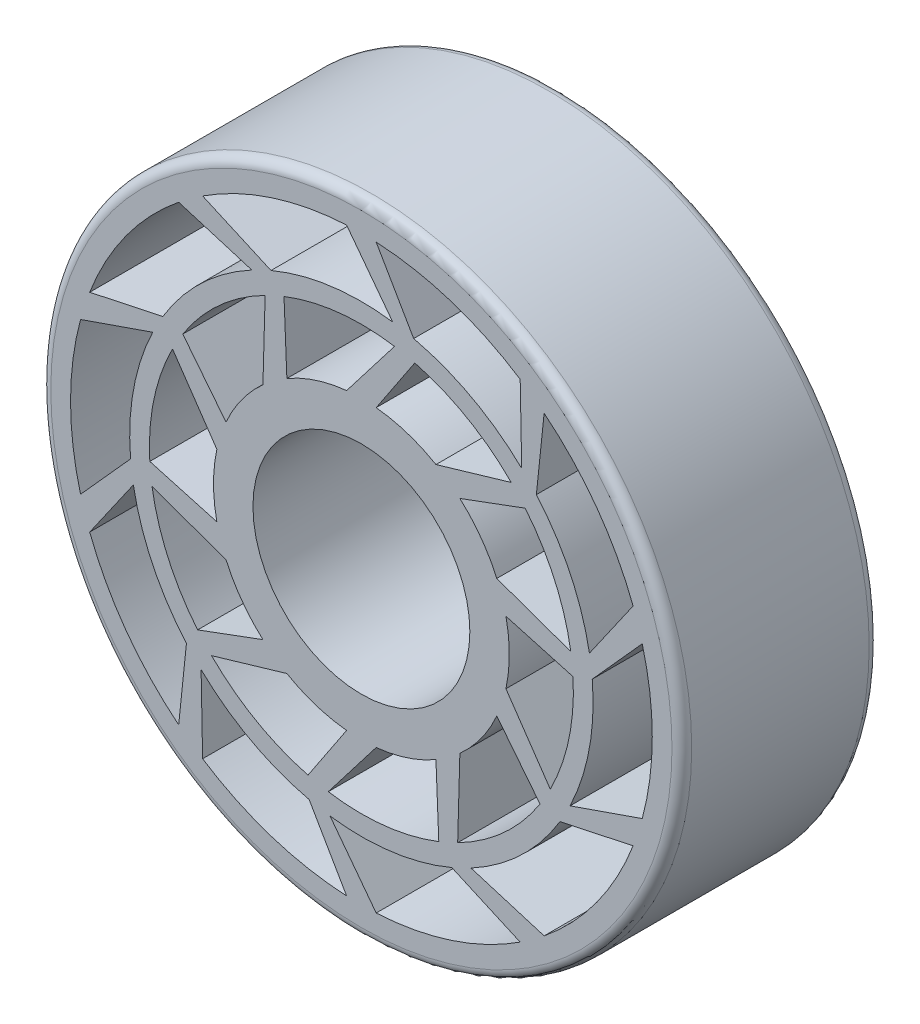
ISO-10303-21;
HEADER;
FILE_DESCRIPTION(('STEP AP214'),'2;1');
FILE_NAME('part.step','',(''),(''),'','','');
FILE_SCHEMA(('AUTOMOTIVE_DESIGN { 1 0 10303 214 1 1 1 1 }'));
ENDSEC;
DATA;
#1=APPLICATION_CONTEXT('core data for automotive mechanical design processes');
#2=APPLICATION_PROTOCOL_DEFINITION('international standard','automotive_design',2000,#1);
#3=PRODUCT_CONTEXT('',#1,'mechanical');
#4=PRODUCT('Part','Part','',(#3));
#5=PRODUCT_RELATED_PRODUCT_CATEGORY('part','',(#4));
#6=PRODUCT_DEFINITION_FORMATION('','',#4);
#7=PRODUCT_DEFINITION_CONTEXT('part definition',#1,'design');
#8=PRODUCT_DEFINITION('design','',#6,#7);
#9=PRODUCT_DEFINITION_SHAPE('','',#8);
#10=(LENGTH_UNIT() NAMED_UNIT(*) SI_UNIT(.MILLI.,.METRE.));
#11=(NAMED_UNIT(*) PLANE_ANGLE_UNIT() SI_UNIT($,.RADIAN.));
#12=(NAMED_UNIT(*) SI_UNIT($,.STERADIAN.) SOLID_ANGLE_UNIT());
#13=UNCERTAINTY_MEASURE_WITH_UNIT(LENGTH_MEASURE(1.E-05),#10,'distance_accuracy_value','');
#14=(GEOMETRIC_REPRESENTATION_CONTEXT(3) GLOBAL_UNCERTAINTY_ASSIGNED_CONTEXT((#13)) GLOBAL_UNIT_ASSIGNED_CONTEXT((#10,
#11,#12)) REPRESENTATION_CONTEXT('',''));
#15=CARTESIAN_POINT('',(0.,0.,0.));
#16=DIRECTION('',(0.,0.,1.));
#17=DIRECTION('',(1.,0.,0.));
#18=AXIS2_PLACEMENT_3D('',#15,#16,#17);
#19=CARTESIAN_POINT('',(0.,0.,20.));
#20=DIRECTION('',(0.,0.,-1.));
#21=DIRECTION('',(-1.,0.,0.));
#22=AXIS2_PLACEMENT_3D('',#19,#20,#21);
#23=CYLINDRICAL_SURFACE('',#22,21.5);
#24=CARTESIAN_POINT('',(0.,0.,0.));
#25=DIRECTION('',(0.,0.,1.));
#26=DIRECTION('',(1.,0.,0.));
#27=AXIS2_PLACEMENT_3D('',#24,#25,#26);
#28=CIRCLE('',#27,21.5);
#29=CARTESIAN_POINT('',(9.76366771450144,-19.155176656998,0.));
#30=VERTEX_POINT('',#29);
#31=CARTESIAN_POINT('',(18.1150607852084,-11.5799211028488,0.));
#32=VERTEX_POINT('',#31);
#33=EDGE_CURVE('E641',#30,#32,#28,.T.);
#34=ORIENTED_EDGE('',*,*,#33,.F.);
#35=DIRECTION('',(0.,0.,-1.));
#36=VECTOR('',#35,1.);
#37=CARTESIAN_POINT('',(9.76366771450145,-19.155176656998,20.));
#38=LINE('',#37,#36);
#39=CARTESIAN_POINT('',(9.76366771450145,-19.155176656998,20.));
#40=VERTEX_POINT('',#39);
#41=EDGE_CURVE('E1149',#40,#30,#38,.T.);
#42=ORIENTED_EDGE('',*,*,#41,.F.);
#43=CARTESIAN_POINT('',(0.,0.,20.));
#44=DIRECTION('',(0.,0.,1.));
#45=DIRECTION('',(1.,0.,0.));
#46=AXIS2_PLACEMENT_3D('',#43,#44,#45);
#47=CIRCLE('',#46,21.5);
#48=CARTESIAN_POINT('',(18.1150607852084,-11.5799211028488,20.));
#49=VERTEX_POINT('',#48);
#50=EDGE_CURVE('E598',#40,#49,#47,.T.);
#51=ORIENTED_EDGE('',*,*,#50,.T.);
#52=DIRECTION('',(0.,0.,-1.));
#53=VECTOR('',#52,1.);
#54=CARTESIAN_POINT('',(18.1150607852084,-11.5799211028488,20.));
#55=LINE('',#54,#53);
#56=EDGE_CURVE('E1081',#49,#32,#55,.T.);
#57=ORIENTED_EDGE('',*,*,#56,.T.);
#58=EDGE_LOOP('',(#34,#42,#51,#57));
#59=FACE_BOUND('',#58,.T.);
#60=ADVANCED_FACE('F43',(#59),#23,.F.);
#61=CARTESIAN_POINT('',(-3.36015723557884,-21.2358033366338,20.));
#62=VERTEX_POINT('',#61);
#63=CARTESIAN_POINT('',(7.84888518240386,-20.016118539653,20.));
#64=VERTEX_POINT('',#63);
#65=EDGE_CURVE('E593',#62,#64,#47,.T.);
#66=ORIENTED_EDGE('',*,*,#65,.T.);
#67=DIRECTION('',(0.,0.,-1.));
#68=VECTOR('',#67,1.);
#69=CARTESIAN_POINT('',(7.84888518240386,-20.016118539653,20.));
#70=LINE('',#69,#68);
#71=CARTESIAN_POINT('',(7.84888518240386,-20.016118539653,0.));
#72=VERTEX_POINT('',#71);
#73=EDGE_CURVE('E1136',#64,#72,#70,.T.);
#74=ORIENTED_EDGE('',*,*,#73,.T.);
#75=CARTESIAN_POINT('',(-3.36015723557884,-21.2358033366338,0.));
#76=VERTEX_POINT('',#75);
#77=EDGE_CURVE('E636',#76,#72,#28,.T.);
#78=ORIENTED_EDGE('',*,*,#77,.F.);
#79=DIRECTION('',(0.,0.,-1.));
#80=VECTOR('',#79,1.);
#81=CARTESIAN_POINT('',(-3.36015723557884,-21.2358033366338,20.));
#82=LINE('',#81,#80);
#83=EDGE_CURVE('E672',#62,#76,#82,.T.);
#84=ORIENTED_EDGE('',*,*,#83,.F.);
#85=EDGE_LOOP('',(#66,#74,#78,#84));
#86=FACE_BOUND('',#85,.T.);
#87=ADVANCED_FACE('F1371',(#86),#23,.F.);
#88=CARTESIAN_POINT('',(21.2347948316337,3.36652468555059,0.));
#89=VERTEX_POINT('',#88);
#90=CARTESIAN_POINT('',(16.6110210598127,13.650054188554,0.));
#91=VERTEX_POINT('',#90);
#92=EDGE_CURVE('E1447',#89,#91,#28,.T.);
#93=ORIENTED_EDGE('',*,*,#92,.F.);
#94=DIRECTION('',(0.,0.,-1.));
#95=VECTOR('',#94,1.);
#96=CARTESIAN_POINT('',(21.2347948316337,3.36652468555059,20.));
#97=LINE('',#96,#95);
#98=CARTESIAN_POINT('',(21.2347948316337,3.36652468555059,20.));
#99=VERTEX_POINT('',#98);
#100=EDGE_CURVE('E1038',#99,#89,#97,.T.);
#101=ORIENTED_EDGE('',*,*,#100,.F.);
#102=CARTESIAN_POINT('',(16.6110210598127,13.650054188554,20.));
#103=VERTEX_POINT('',#102);
#104=EDGE_CURVE('E716',#99,#103,#47,.T.);
#105=ORIENTED_EDGE('',*,*,#104,.T.);
#106=DIRECTION('',(0.,0.,-1.));
#107=VECTOR('',#106,1.);
#108=CARTESIAN_POINT('',(16.6110210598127,13.650054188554,20.));
#109=LINE('',#108,#107);
#110=EDGE_CURVE('E972',#103,#91,#109,.T.);
#111=ORIENTED_EDGE('',*,*,#110,.T.);
#112=EDGE_LOOP('',(#93,#101,#105,#111));
#113=FACE_BOUND('',#112,.T.);
#114=ADVANCED_FACE('F1378',(#113),#23,.F.);
#115=CARTESIAN_POINT('',(19.1581034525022,-9.75792355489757,20.));
#116=VERTEX_POINT('',#115);
#117=CARTESIAN_POINT('',(21.4618988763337,1.27941260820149,20.));
#118=VERTEX_POINT('',#117);
#119=EDGE_CURVE('E752',#116,#118,#47,.T.);
#120=ORIENTED_EDGE('',*,*,#119,.T.);
#121=DIRECTION('',(0.,0.,-1.));
#122=VECTOR('',#121,1.);
#123=CARTESIAN_POINT('',(21.4618988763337,1.27941260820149,20.));
#124=LINE('',#123,#122);
#125=CARTESIAN_POINT('',(21.4618988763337,1.27941260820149,0.));
#126=VERTEX_POINT('',#125);
#127=EDGE_CURVE('E1026',#118,#126,#124,.T.);
#128=ORIENTED_EDGE('',*,*,#127,.T.);
#129=CARTESIAN_POINT('',(19.1581034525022,-9.75792355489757,0.));
#130=VERTEX_POINT('',#129);
#131=EDGE_CURVE('E1453',#130,#126,#28,.T.);
#132=ORIENTED_EDGE('',*,*,#131,.F.);
#133=DIRECTION('',(0.,0.,-1.));
#134=VECTOR('',#133,1.);
#135=CARTESIAN_POINT('',(19.1581034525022,-9.75792355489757,20.));
#136=LINE('',#135,#134);
#137=EDGE_CURVE('E1093',#116,#130,#136,.T.);
#138=ORIENTED_EDGE('',*,*,#137,.F.);
#139=EDGE_LOOP('',(#120,#128,#132,#138));
#140=FACE_BOUND('',#139,.T.);
#141=ADVANCED_FACE('F1832',(#140),#23,.F.);
#142=CARTESIAN_POINT('',(3.36015723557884,21.2358033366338,0.));
#143=VERTEX_POINT('',#142);
#144=CARTESIAN_POINT('',(-7.848885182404,20.016118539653,0.));
#145=VERTEX_POINT('',#144);
#146=EDGE_CURVE('E1435',#143,#145,#28,.T.);
#147=ORIENTED_EDGE('',*,*,#146,.F.);
#148=DIRECTION('',(0.,0.,-1.));
#149=VECTOR('',#148,1.);
#150=CARTESIAN_POINT('',(3.36015723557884,21.2358033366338,20.));
#151=LINE('',#150,#149);
#152=CARTESIAN_POINT('',(3.36015723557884,21.2358033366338,20.));
#153=VERTEX_POINT('',#152);
#154=EDGE_CURVE('E930',#153,#143,#151,.T.);
#155=ORIENTED_EDGE('',*,*,#154,.F.);
#156=CARTESIAN_POINT('',(-7.848885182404,20.016118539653,20.));
#157=VERTEX_POINT('',#156);
#158=EDGE_CURVE('E726',#153,#157,#47,.T.);
#159=ORIENTED_EDGE('',*,*,#158,.T.);
#160=DIRECTION('',(0.,0.,-1.));
#161=VECTOR('',#160,1.);
#162=CARTESIAN_POINT('',(-7.848885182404,20.016118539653,20.));
#163=LINE('',#162,#161);
#164=EDGE_CURVE('E864',#157,#145,#163,.T.);
#165=ORIENTED_EDGE('',*,*,#164,.T.);
#166=EDGE_LOOP('',(#147,#155,#159,#165));
#167=FACE_BOUND('',#166,.T.);
#168=ADVANCED_FACE('F1827',(#167),#23,.F.);
#169=CARTESIAN_POINT('',(15.2005163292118,15.205074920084,20.));
#170=VERTEX_POINT('',#169);
#171=CARTESIAN_POINT('',(5.4152977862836,20.8068390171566,20.));
#172=VERTEX_POINT('',#171);
#173=EDGE_CURVE('E721',#170,#172,#47,.T.);
#174=ORIENTED_EDGE('',*,*,#173,.T.);
#175=DIRECTION('',(0.,0.,-1.));
#176=VECTOR('',#175,1.);
#177=CARTESIAN_POINT('',(5.4152977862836,20.8068390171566,20.));
#178=LINE('',#177,#176);
#179=CARTESIAN_POINT('',(5.4152977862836,20.8068390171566,0.));
#180=VERTEX_POINT('',#179);
#181=EDGE_CURVE('E918',#172,#180,#178,.T.);
#182=ORIENTED_EDGE('',*,*,#181,.T.);
#183=CARTESIAN_POINT('',(15.2005163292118,15.205074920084,0.));
#184=VERTEX_POINT('',#183);
#185=EDGE_CURVE('E1441',#184,#180,#28,.T.);
#186=ORIENTED_EDGE('',*,*,#185,.F.);
#187=DIRECTION('',(0.,0.,-1.));
#188=VECTOR('',#187,1.);
#189=CARTESIAN_POINT('',(15.2005163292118,15.205074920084,20.));
#190=LINE('',#189,#188);
#191=EDGE_CURVE('E984',#170,#184,#190,.T.);
#192=ORIENTED_EDGE('',*,*,#191,.F.);
#193=EDGE_LOOP('',(#174,#182,#186,#192));
#194=FACE_BOUND('',#193,.T.);
#195=ADVANCED_FACE('F1822',(#194),#23,.F.);
#196=CARTESIAN_POINT('',(-19.1581034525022,9.75792355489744,0.));
#197=VERTEX_POINT('',#196);
#198=CARTESIAN_POINT('',(-21.4618988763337,-1.27941260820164,0.));
#199=VERTEX_POINT('',#198);
#200=EDGE_CURVE('E1424',#197,#199,#28,.T.);
#201=ORIENTED_EDGE('',*,*,#200,.F.);
#202=DIRECTION('',(0.,0.,-1.));
#203=VECTOR('',#202,1.);
#204=CARTESIAN_POINT('',(-19.1581034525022,9.75792355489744,20.));
#205=LINE('',#204,#203);
#206=CARTESIAN_POINT('',(-19.1581034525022,9.75792355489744,20.));
#207=VERTEX_POINT('',#206);
#208=EDGE_CURVE('E823',#207,#197,#205,.T.);
#209=ORIENTED_EDGE('',*,*,#208,.F.);
#210=CARTESIAN_POINT('',(-21.4618988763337,-1.27941260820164,20.));
#211=VERTEX_POINT('',#210);
#212=EDGE_CURVE('E736',#207,#211,#47,.T.);
#213=ORIENTED_EDGE('',*,*,#212,.T.);
#214=DIRECTION('',(0.,0.,-1.));
#215=VECTOR('',#214,1.);
#216=CARTESIAN_POINT('',(-21.4618988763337,-1.27941260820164,20.));
#217=LINE('',#216,#215);
#218=EDGE_CURVE('E1574',#211,#199,#217,.T.);
#219=ORIENTED_EDGE('',*,*,#218,.T.);
#220=EDGE_LOOP('',(#201,#209,#213,#219));
#221=FACE_BOUND('',#220,.T.);
#222=ADVANCED_FACE('F1819',(#221),#23,.F.);
#223=CARTESIAN_POINT('',(-9.76366771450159,19.155176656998,20.));
#224=VERTEX_POINT('',#223);
#225=CARTESIAN_POINT('',(-18.1150607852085,11.5799211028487,20.));
#226=VERTEX_POINT('',#225);
#227=EDGE_CURVE('E731',#224,#226,#47,.T.);
#228=ORIENTED_EDGE('',*,*,#227,.T.);
#229=DIRECTION('',(0.,0.,-1.));
#230=VECTOR('',#229,1.);
#231=CARTESIAN_POINT('',(-18.1150607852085,11.5799211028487,20.));
#232=LINE('',#231,#230);
#233=CARTESIAN_POINT('',(-18.1150607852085,11.5799211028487,0.));
#234=VERTEX_POINT('',#233);
#235=EDGE_CURVE('E811',#226,#234,#232,.T.);
#236=ORIENTED_EDGE('',*,*,#235,.T.);
#237=CARTESIAN_POINT('',(-9.76366771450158,19.155176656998,0.));
#238=VERTEX_POINT('',#237);
#239=EDGE_CURVE('E1429',#238,#234,#28,.T.);
#240=ORIENTED_EDGE('',*,*,#239,.F.);
#241=DIRECTION('',(0.,0.,-1.));
#242=VECTOR('',#241,1.);
#243=CARTESIAN_POINT('',(-9.76366771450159,19.155176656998,20.));
#244=LINE('',#243,#242);
#245=EDGE_CURVE('E876',#224,#238,#244,.T.);
#246=ORIENTED_EDGE('',*,*,#245,.F.);
#247=EDGE_LOOP('',(#228,#236,#240,#246));
#248=FACE_BOUND('',#247,.T.);
#249=ADVANCED_FACE('F1395',(#248),#23,.F.);
#250=CARTESIAN_POINT('',(-15.2005163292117,-15.2050749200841,0.));
#251=VERTEX_POINT('',#250);
#252=CARTESIAN_POINT('',(-5.4152977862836,-20.8068390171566,0.));
#253=VERTEX_POINT('',#252);
#254=EDGE_CURVE('E635',#251,#253,#28,.T.);
#255=ORIENTED_EDGE('',*,*,#254,.F.);
#256=DIRECTION('',(0.,0.,-1.));
#257=VECTOR('',#256,1.);
#258=CARTESIAN_POINT('',(-15.2005163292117,-15.2050749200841,20.));
#259=LINE('',#258,#257);
#260=CARTESIAN_POINT('',(-15.2005163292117,-15.2050749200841,20.));
#261=VERTEX_POINT('',#260);
#262=EDGE_CURVE('E1411',#261,#251,#259,.T.);
#263=ORIENTED_EDGE('',*,*,#262,.F.);
#264=CARTESIAN_POINT('',(-5.4152977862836,-20.8068390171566,20.));
#265=VERTEX_POINT('',#264);
#266=EDGE_CURVE('E592',#261,#265,#47,.T.);
#267=ORIENTED_EDGE('',*,*,#266,.T.);
#268=DIRECTION('',(0.,0.,-1.));
#269=VECTOR('',#268,1.);
#270=CARTESIAN_POINT('',(-5.4152977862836,-20.8068390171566,20.));
#271=LINE('',#270,#269);
#272=EDGE_CURVE('E659',#265,#253,#271,.T.);
#273=ORIENTED_EDGE('',*,*,#272,.T.);
#274=EDGE_LOOP('',(#255,#263,#267,#273));
#275=FACE_BOUND('',#274,.T.);
#276=ADVANCED_FACE('F1385',(#275),#23,.F.);
#277=CARTESIAN_POINT('',(-21.2347948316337,-3.36652468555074,20.));
#278=VERTEX_POINT('',#277);
#279=CARTESIAN_POINT('',(-16.6110210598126,-13.6500541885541,20.));
#280=VERTEX_POINT('',#279);
#281=EDGE_CURVE('E741',#278,#280,#47,.T.);
#282=ORIENTED_EDGE('',*,*,#281,.T.);
#283=DIRECTION('',(0.,0.,-1.));
#284=VECTOR('',#283,1.);
#285=CARTESIAN_POINT('',(-16.6110210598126,-13.6500541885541,20.));
#286=LINE('',#285,#284);
#287=CARTESIAN_POINT('',(-16.6110210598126,-13.6500541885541,0.));
#288=VERTEX_POINT('',#287);
#289=EDGE_CURVE('E1401',#280,#288,#286,.T.);
#290=ORIENTED_EDGE('',*,*,#289,.T.);
#291=CARTESIAN_POINT('',(-21.2347948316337,-3.36652468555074,0.));
#292=VERTEX_POINT('',#291);
#293=EDGE_CURVE('E1422',#292,#288,#28,.T.);
#294=ORIENTED_EDGE('',*,*,#293,.F.);
#295=DIRECTION('',(0.,0.,-1.));
#296=VECTOR('',#295,1.);
#297=CARTESIAN_POINT('',(-21.2347948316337,-3.36652468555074,20.));
#298=LINE('',#297,#296);
#299=EDGE_CURVE('E802',#278,#292,#298,.T.);
#300=ORIENTED_EDGE('',*,*,#299,.F.);
#301=EDGE_LOOP('',(#282,#290,#294,#300));
#302=FACE_BOUND('',#301,.T.);
#303=ADVANCED_FACE('F1374',(#302),#23,.F.);
#304=CARTESIAN_POINT('',(0.,0.,20.));
#305=DIRECTION('',(0.,0.,-1.));
#306=DIRECTION('',(-1.,0.,0.));
#307=AXIS2_PLACEMENT_3D('',#304,#305,#306);
#308=CYLINDRICAL_SURFACE('',#307,15.);
#309=DIRECTION('',(0.,0.,-1.));
#310=VECTOR('',#309,1.);
#311=CARTESIAN_POINT('',(9.98610961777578,-11.1927483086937,20.));
#312=LINE('',#311,#310);
#313=CARTESIAN_POINT('',(9.98610961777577,-11.1927483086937,20.));
#314=VERTEX_POINT('',#313);
#315=CARTESIAN_POINT('',(9.98610961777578,-11.1927483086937,0.));
#316=VERTEX_POINT('',#315);
#317=EDGE_CURVE('E1145',#314,#316,#312,.T.);
#318=ORIENTED_EDGE('',*,*,#317,.T.);
#319=CARTESIAN_POINT('',(0.,0.,0.));
#320=DIRECTION('',(0.,0.,1.));
#321=DIRECTION('',(1.,0.,0.));
#322=AXIS2_PLACEMENT_3D('',#319,#320,#321);
#323=CIRCLE('',#322,15.);
#324=CARTESIAN_POINT('',(13.7308137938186,-6.03860518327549,0.));
#325=VERTEX_POINT('',#324);
#326=EDGE_CURVE('E650',#316,#325,#323,.T.);
#327=ORIENTED_EDGE('',*,*,#326,.T.);
#328=DIRECTION('',(0.,0.,-1.));
#329=VECTOR('',#328,1.);
#330=CARTESIAN_POINT('',(13.7308137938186,-6.03860518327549,20.));
#331=LINE('',#330,#329);
#332=CARTESIAN_POINT('',(13.7308137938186,-6.03860518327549,20.));
#333=VERTEX_POINT('',#332);
#334=EDGE_CURVE('E1085',#333,#325,#331,.T.);
#335=ORIENTED_EDGE('',*,*,#334,.F.);
#336=CARTESIAN_POINT('',(0.,0.,20.));
#337=DIRECTION('',(0.,0.,1.));
#338=DIRECTION('',(1.,0.,0.));
#339=AXIS2_PLACEMENT_3D('',#336,#337,#338);
#340=CIRCLE('',#339,15.);
#341=EDGE_CURVE('E607',#314,#333,#340,.T.);
#342=ORIENTED_EDGE('',*,*,#341,.F.);
#343=EDGE_LOOP('',(#318,#327,#335,#342));
#344=FACE_BOUND('',#343,.T.);
#345=ADVANCED_FACE('F1384',(#344),#308,.T.);
#346=DIRECTION('',(0.,0.,-1.));
#347=VECTOR('',#346,1.);
#348=CARTESIAN_POINT('',(7.55905863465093,-12.9561040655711,20.));
#349=LINE('',#348,#347);
#350=CARTESIAN_POINT('',(7.55905863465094,-12.9561040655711,20.));
#351=VERTEX_POINT('',#350);
#352=CARTESIAN_POINT('',(7.55905863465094,-12.9561040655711,0.));
#353=VERTEX_POINT('',#352);
#354=EDGE_CURVE('E1140',#351,#353,#349,.T.);
#355=ORIENTED_EDGE('',*,*,#354,.F.);
#356=CARTESIAN_POINT('',(1.5,-14.9248115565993,20.));
#357=VERTEX_POINT('',#356);
#358=EDGE_CURVE('E602',#357,#351,#340,.T.);
#359=ORIENTED_EDGE('',*,*,#358,.F.);
#360=DIRECTION('',(0.,0.,-1.));
#361=VECTOR('',#360,1.);
#362=CARTESIAN_POINT('',(1.5,-14.9248115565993,20.));
#363=LINE('',#362,#361);
#364=CARTESIAN_POINT('',(1.5,-14.9248115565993,0.));
#365=VERTEX_POINT('',#364);
#366=EDGE_CURVE('E668',#357,#365,#363,.T.);
#367=ORIENTED_EDGE('',*,*,#366,.T.);
#368=EDGE_CURVE('E646',#365,#353,#323,.T.);
#369=ORIENTED_EDGE('',*,*,#368,.T.);
#370=EDGE_LOOP('',(#355,#359,#367,#369));
#371=FACE_BOUND('',#370,.T.);
#372=ADVANCED_FACE('F1391',(#371),#308,.T.);
#373=DIRECTION('',(0.,0.,-1.));
#374=VECTOR('',#373,1.);
#375=CARTESIAN_POINT('',(13.7308137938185,6.03860518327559,20.));
#376=LINE('',#375,#374);
#377=CARTESIAN_POINT('',(13.7308137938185,6.03860518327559,20.));
#378=VERTEX_POINT('',#377);
#379=CARTESIAN_POINT('',(13.7308137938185,6.03860518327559,0.));
#380=VERTEX_POINT('',#379);
#381=EDGE_CURVE('E1035',#378,#380,#376,.T.);
#382=ORIENTED_EDGE('',*,*,#381,.T.);
#383=CARTESIAN_POINT('',(9.98610961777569,11.1927483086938,0.));
#384=VERTEX_POINT('',#383);
#385=EDGE_CURVE('E1697',#380,#384,#323,.T.);
#386=ORIENTED_EDGE('',*,*,#385,.T.);
#387=DIRECTION('',(0.,0.,-1.));
#388=VECTOR('',#387,1.);
#389=CARTESIAN_POINT('',(9.9861096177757,11.1927483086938,20.));
#390=LINE('',#389,#388);
#391=CARTESIAN_POINT('',(9.98610961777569,11.1927483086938,20.));
#392=VERTEX_POINT('',#391);
#393=EDGE_CURVE('E976',#392,#384,#390,.T.);
#394=ORIENTED_EDGE('',*,*,#393,.F.);
#395=EDGE_CURVE('E1476',#378,#392,#340,.T.);
#396=ORIENTED_EDGE('',*,*,#395,.F.);
#397=EDGE_LOOP('',(#382,#386,#394,#396));
#398=FACE_BOUND('',#397,.T.);
#399=ADVANCED_FACE('F1684',(#398),#308,.T.);
#400=DIRECTION('',(0.,0.,-1.));
#401=VECTOR('',#400,1.);
#402=CARTESIAN_POINT('',(14.6578647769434,3.18543563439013,20.));
#403=LINE('',#402,#401);
#404=CARTESIAN_POINT('',(14.6578647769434,3.18543563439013,20.));
#405=VERTEX_POINT('',#404);
#406=CARTESIAN_POINT('',(14.6578647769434,3.18543563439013,0.));
#407=VERTEX_POINT('',#406);
#408=EDGE_CURVE('E1030',#405,#407,#403,.T.);
#409=ORIENTED_EDGE('',*,*,#408,.F.);
#410=CARTESIAN_POINT('',(14.6578647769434,-3.18543563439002,20.));
#411=VERTEX_POINT('',#410);
#412=EDGE_CURVE('E1473',#411,#405,#340,.T.);
#413=ORIENTED_EDGE('',*,*,#412,.F.);
#414=DIRECTION('',(0.,0.,-1.));
#415=VECTOR('',#414,1.);
#416=CARTESIAN_POINT('',(14.6578647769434,-3.18543563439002,20.));
#417=LINE('',#416,#415);
#418=CARTESIAN_POINT('',(14.6578647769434,-3.18543563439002,0.));
#419=VERTEX_POINT('',#418);
#420=EDGE_CURVE('E1090',#411,#419,#417,.T.);
#421=ORIENTED_EDGE('',*,*,#420,.T.);
#422=EDGE_CURVE('E1700',#419,#407,#323,.T.);
#423=ORIENTED_EDGE('',*,*,#422,.T.);
#424=EDGE_LOOP('',(#409,#413,#421,#423));
#425=FACE_BOUND('',#424,.T.);
#426=ADVANCED_FACE('F1688',(#425),#308,.T.);
#427=DIRECTION('',(0.,0.,-1.));
#428=VECTOR('',#427,1.);
#429=CARTESIAN_POINT('',(-1.5,14.9248115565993,20.));
#430=LINE('',#429,#428);
#431=CARTESIAN_POINT('',(-1.5,14.9248115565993,20.));
#432=VERTEX_POINT('',#431);
#433=CARTESIAN_POINT('',(-1.5,14.9248115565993,0.));
#434=VERTEX_POINT('',#433);
#435=EDGE_CURVE('E927',#432,#434,#430,.T.);
#436=ORIENTED_EDGE('',*,*,#435,.T.);
#437=CARTESIAN_POINT('',(-7.55905863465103,12.9561040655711,0.));
#438=VERTEX_POINT('',#437);
#439=EDGE_CURVE('E1518',#434,#438,#323,.T.);
#440=ORIENTED_EDGE('',*,*,#439,.T.);
#441=DIRECTION('',(0.,0.,-1.));
#442=VECTOR('',#441,1.);
#443=CARTESIAN_POINT('',(-7.55905863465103,12.9561040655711,20.));
#444=LINE('',#443,#442);
#445=CARTESIAN_POINT('',(-7.55905863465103,12.9561040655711,20.));
#446=VERTEX_POINT('',#445);
#447=EDGE_CURVE('E868',#446,#438,#444,.T.);
#448=ORIENTED_EDGE('',*,*,#447,.F.);
#449=EDGE_CURVE('E1484',#432,#446,#340,.T.);
#450=ORIENTED_EDGE('',*,*,#449,.F.);
#451=EDGE_LOOP('',(#436,#440,#448,#450));
#452=FACE_BOUND('',#451,.T.);
#453=ADVANCED_FACE('F1693',(#452),#308,.T.);
#454=DIRECTION('',(0.,0.,-1.));
#455=VECTOR('',#454,1.);
#456=CARTESIAN_POINT('',(1.5,14.9248115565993,20.));
#457=LINE('',#456,#455);
#458=CARTESIAN_POINT('',(1.5,14.9248115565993,20.));
#459=VERTEX_POINT('',#458);
#460=CARTESIAN_POINT('',(1.5,14.9248115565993,0.));
#461=VERTEX_POINT('',#460);
#462=EDGE_CURVE('E922',#459,#461,#457,.T.);
#463=ORIENTED_EDGE('',*,*,#462,.F.);
#464=CARTESIAN_POINT('',(7.55905863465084,12.9561040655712,20.));
#465=VERTEX_POINT('',#464);
#466=EDGE_CURVE('E1480',#465,#459,#340,.T.);
#467=ORIENTED_EDGE('',*,*,#466,.F.);
#468=DIRECTION('',(0.,0.,-1.));
#469=VECTOR('',#468,1.);
#470=CARTESIAN_POINT('',(7.55905863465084,12.9561040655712,20.));
#471=LINE('',#470,#469);
#472=CARTESIAN_POINT('',(7.55905863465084,12.9561040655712,0.));
#473=VERTEX_POINT('',#472);
#474=EDGE_CURVE('E981',#465,#473,#471,.T.);
#475=ORIENTED_EDGE('',*,*,#474,.T.);
#476=EDGE_CURVE('E1522',#473,#461,#323,.T.);
#477=ORIENTED_EDGE('',*,*,#476,.T.);
#478=EDGE_LOOP('',(#463,#467,#475,#477));
#479=FACE_BOUND('',#478,.T.);
#480=ADVANCED_FACE('F1811',(#479),#308,.T.);
#481=DIRECTION('',(0.,0.,-1.));
#482=VECTOR('',#481,1.);
#483=CARTESIAN_POINT('',(-14.6578647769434,3.18543563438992,20.));
#484=LINE('',#483,#482);
#485=CARTESIAN_POINT('',(-14.6578647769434,3.18543563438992,20.));
#486=VERTEX_POINT('',#485);
#487=CARTESIAN_POINT('',(-14.6578647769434,3.18543563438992,0.));
#488=VERTEX_POINT('',#487);
#489=EDGE_CURVE('E820',#486,#488,#484,.T.);
#490=ORIENTED_EDGE('',*,*,#489,.T.);
#491=CARTESIAN_POINT('',(-14.6578647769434,-3.18543563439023,0.));
#492=VERTEX_POINT('',#491);
#493=EDGE_CURVE('E1519',#488,#492,#323,.T.);
#494=ORIENTED_EDGE('',*,*,#493,.T.);
#495=DIRECTION('',(0.,0.,-1.));
#496=VECTOR('',#495,1.);
#497=CARTESIAN_POINT('',(-14.6578647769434,-3.18543563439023,20.));
#498=LINE('',#497,#496);
#499=CARTESIAN_POINT('',(-14.6578647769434,-3.18543563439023,20.));
#500=VERTEX_POINT('',#499);
#501=EDGE_CURVE('E1578',#500,#492,#498,.T.);
#502=ORIENTED_EDGE('',*,*,#501,.F.);
#503=EDGE_CURVE('E1492',#486,#500,#340,.T.);
#504=ORIENTED_EDGE('',*,*,#503,.F.);
#505=EDGE_LOOP('',(#490,#494,#502,#504));
#506=FACE_BOUND('',#505,.T.);
#507=ADVANCED_FACE('F1807',(#506),#308,.T.);
#508=DIRECTION('',(0.,0.,-1.));
#509=VECTOR('',#508,1.);
#510=CARTESIAN_POINT('',(-13.7308137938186,6.0386051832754,20.));
#511=LINE('',#510,#509);
#512=CARTESIAN_POINT('',(-13.7308137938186,6.03860518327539,20.));
#513=VERTEX_POINT('',#512);
#514=CARTESIAN_POINT('',(-13.7308137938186,6.03860518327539,0.));
#515=VERTEX_POINT('',#514);
#516=EDGE_CURVE('E815',#513,#515,#511,.T.);
#517=ORIENTED_EDGE('',*,*,#516,.F.);
#518=CARTESIAN_POINT('',(-9.98610961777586,11.1927483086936,20.));
#519=VERTEX_POINT('',#518);
#520=EDGE_CURVE('E1488',#519,#513,#340,.T.);
#521=ORIENTED_EDGE('',*,*,#520,.F.);
#522=DIRECTION('',(0.,0.,-1.));
#523=VECTOR('',#522,1.);
#524=CARTESIAN_POINT('',(-9.98610961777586,11.1927483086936,20.));
#525=LINE('',#524,#523);
#526=CARTESIAN_POINT('',(-9.98610961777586,11.1927483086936,0.));
#527=VERTEX_POINT('',#526);
#528=EDGE_CURVE('E873',#519,#527,#525,.T.);
#529=ORIENTED_EDGE('',*,*,#528,.T.);
#530=EDGE_CURVE('E1516',#527,#515,#323,.T.);
#531=ORIENTED_EDGE('',*,*,#530,.T.);
#532=EDGE_LOOP('',(#517,#521,#529,#531));
#533=FACE_BOUND('',#532,.T.);
#534=ADVANCED_FACE('F1515',(#533),#308,.T.);
#535=DIRECTION('',(0.,0.,-1.));
#536=VECTOR('',#535,1.);
#537=CARTESIAN_POINT('',(-7.55905863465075,-12.9561040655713,20.));
#538=LINE('',#537,#536);
#539=CARTESIAN_POINT('',(-7.55905863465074,-12.9561040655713,20.));
#540=VERTEX_POINT('',#539);
#541=CARTESIAN_POINT('',(-7.55905863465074,-12.9561040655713,0.));
#542=VERTEX_POINT('',#541);
#543=EDGE_CURVE('E1531',#540,#542,#538,.T.);
#544=ORIENTED_EDGE('',*,*,#543,.T.);
#545=CARTESIAN_POINT('',(-1.5,-14.9248115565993,0.));
#546=VERTEX_POINT('',#545);
#547=EDGE_CURVE('E645',#542,#546,#323,.T.);
#548=ORIENTED_EDGE('',*,*,#547,.T.);
#549=DIRECTION('',(0.,0.,-1.));
#550=VECTOR('',#549,1.);
#551=CARTESIAN_POINT('',(-1.5,-14.9248115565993,20.));
#552=LINE('',#551,#550);
#553=CARTESIAN_POINT('',(-1.5,-14.9248115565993,20.));
#554=VERTEX_POINT('',#553);
#555=EDGE_CURVE('E663',#554,#546,#552,.T.);
#556=ORIENTED_EDGE('',*,*,#555,.F.);
#557=EDGE_CURVE('E59',#540,#554,#340,.T.);
#558=ORIENTED_EDGE('',*,*,#557,.F.);
#559=EDGE_LOOP('',(#544,#548,#556,#558));
#560=FACE_BOUND('',#559,.T.);
#561=ADVANCED_FACE('F1529',(#560),#308,.T.);
#562=DIRECTION('',(0.,0.,-1.));
#563=VECTOR('',#562,1.);
#564=CARTESIAN_POINT('',(-9.98610961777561,-11.1927483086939,20.));
#565=LINE('',#564,#563);
#566=CARTESIAN_POINT('',(-9.98610961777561,-11.1927483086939,20.));
#567=VERTEX_POINT('',#566);
#568=CARTESIAN_POINT('',(-9.98610961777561,-11.1927483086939,0.));
#569=VERTEX_POINT('',#568);
#570=EDGE_CURVE('E67',#567,#569,#565,.T.);
#571=ORIENTED_EDGE('',*,*,#570,.F.);
#572=CARTESIAN_POINT('',(-13.7308137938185,-6.03860518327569,20.));
#573=VERTEX_POINT('',#572);
#574=EDGE_CURVE('E1496',#573,#567,#340,.T.);
#575=ORIENTED_EDGE('',*,*,#574,.F.);
#576=DIRECTION('',(0.,0.,-1.));
#577=VECTOR('',#576,1.);
#578=CARTESIAN_POINT('',(-13.7308137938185,-6.03860518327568,20.));
#579=LINE('',#578,#577);
#580=CARTESIAN_POINT('',(-13.7308137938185,-6.03860518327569,0.));
#581=VERTEX_POINT('',#580);
#582=EDGE_CURVE('E1583',#573,#581,#579,.T.);
#583=ORIENTED_EDGE('',*,*,#582,.T.);
#584=EDGE_CURVE('E1523',#581,#569,#323,.T.);
#585=ORIENTED_EDGE('',*,*,#584,.T.);
#586=EDGE_LOOP('',(#571,#575,#583,#585));
#587=FACE_BOUND('',#586,.T.);
#588=ADVANCED_FACE('F1394',(#587),#308,.T.);
#589=CARTESIAN_POINT('',(0.,0.,20.));
#590=DIRECTION('',(0.,0.,-1.));
#591=DIRECTION('',(-1.,0.,0.));
#592=AXIS2_PLACEMENT_3D('',#589,#590,#591);
#593=CYLINDRICAL_SURFACE('',#592,23.5);
#594=DIRECTION('',(0.,0.,-1.));
#595=VECTOR('',#594,1.);
#596=CARTESIAN_POINT('',(9.16903105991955,-21.6374413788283,20.));
#597=LINE('',#596,#595);
#598=CARTESIAN_POINT('',(9.16903105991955,-21.6374413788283,20.));
#599=VERTEX_POINT('',#598);
#600=CARTESIAN_POINT('',(9.16903105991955,-21.6374413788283,0.));
#601=VERTEX_POINT('',#600);
#602=EDGE_CURVE('E1141',#599,#601,#597,.T.);
#603=ORIENTED_EDGE('',*,*,#602,.F.);
#604=CARTESIAN_POINT('',(0.,0.,20.));
#605=DIRECTION('',(0.,0.,1.));
#606=DIRECTION('',(1.,0.,0.));
#607=AXIS2_PLACEMENT_3D('',#604,#605,#606);
#608=CIRCLE('',#607,23.5);
#609=CARTESIAN_POINT('',(-3.17845590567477,-23.2840593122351,20.));
#610=VERTEX_POINT('',#609);
#611=EDGE_CURVE('E1166',#610,#599,#608,.T.);
#612=ORIENTED_EDGE('',*,*,#611,.F.);
#613=DIRECTION('',(0.,0.,-1.));
#614=VECTOR('',#613,1.);
#615=CARTESIAN_POINT('',(-3.17845590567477,-23.2840593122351,20.));
#616=LINE('',#615,#614);
#617=CARTESIAN_POINT('',(-3.17845590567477,-23.2840593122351,0.));
#618=VERTEX_POINT('',#617);
#619=EDGE_CURVE('E615',#610,#618,#616,.T.);
#620=ORIENTED_EDGE('',*,*,#619,.T.);
#621=CARTESIAN_POINT('',(0.,0.,0.));
#622=DIRECTION('',(0.,0.,1.));
#623=DIRECTION('',(1.,0.,0.));
#624=AXIS2_PLACEMENT_3D('',#621,#622,#623);
#625=CIRCLE('',#624,23.5);
#626=EDGE_CURVE('E616',#618,#601,#625,.T.);
#627=ORIENTED_EDGE('',*,*,#626,.T.);
#628=EDGE_LOOP('',(#603,#612,#620,#627));
#629=FACE_BOUND('',#628,.T.);
#630=ADVANCED_FACE('F1622',(#629),#593,.T.);
#631=DIRECTION('',(0.,0.,-1.));
#632=VECTOR('',#631,1.);
#633=CARTESIAN_POINT('',(23.4118160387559,2.03392963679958,20.));
#634=LINE('',#633,#632);
#635=CARTESIAN_POINT('',(23.4118160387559,2.03392963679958,20.));
#636=VERTEX_POINT('',#635);
#637=CARTESIAN_POINT('',(23.4118160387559,2.03392963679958,0.));
#638=VERTEX_POINT('',#637);
#639=EDGE_CURVE('E1031',#636,#638,#634,.T.);
#640=ORIENTED_EDGE('',*,*,#639,.F.);
#641=CARTESIAN_POINT('',(21.1622594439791,-10.2180612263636,20.));
#642=VERTEX_POINT('',#641);
#643=EDGE_CURVE('E1178',#642,#636,#608,.T.);
#644=ORIENTED_EDGE('',*,*,#643,.F.);
#645=DIRECTION('',(0.,0.,-1.));
#646=VECTOR('',#645,1.);
#647=CARTESIAN_POINT('',(21.1622594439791,-10.2180612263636,20.));
#648=LINE('',#647,#646);
#649=CARTESIAN_POINT('',(21.1622594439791,-10.2180612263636,0.));
#650=VERTEX_POINT('',#649);
#651=EDGE_CURVE('E1069',#642,#650,#648,.T.);
#652=ORIENTED_EDGE('',*,*,#651,.T.);
#653=EDGE_CURVE('E1308',#650,#638,#625,.T.);
#654=ORIENTED_EDGE('',*,*,#653,.T.);
#655=EDGE_LOOP('',(#640,#644,#652,#654));
#656=FACE_BOUND('',#655,.T.);
#657=ADVANCED_FACE('F1803',(#656),#593,.T.);
#658=DIRECTION('',(0.,0.,-1.));
#659=VECTOR('',#658,1.);
#660=CARTESIAN_POINT('',(5.30026699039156,22.8944790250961,20.));
#661=LINE('',#660,#659);
#662=CARTESIAN_POINT('',(5.30026699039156,22.8944790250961,20.));
#663=VERTEX_POINT('',#662);
#664=CARTESIAN_POINT('',(5.30026699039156,22.8944790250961,0.));
#665=VERTEX_POINT('',#664);
#666=EDGE_CURVE('E923',#663,#665,#661,.T.);
#667=ORIENTED_EDGE('',*,*,#666,.F.);
#668=CARTESIAN_POINT('',(16.2574515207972,16.968950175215,20.));
#669=VERTEX_POINT('',#668);
#670=EDGE_CURVE('E1189',#669,#663,#608,.T.);
#671=ORIENTED_EDGE('',*,*,#670,.F.);
#672=DIRECTION('',(0.,0.,-1.));
#673=VECTOR('',#672,1.);
#674=CARTESIAN_POINT('',(16.2574515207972,16.968950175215,20.));
#675=LINE('',#674,#673);
#676=CARTESIAN_POINT('',(16.2574515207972,16.968950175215,0.));
#677=VERTEX_POINT('',#676);
#678=EDGE_CURVE('E960',#669,#677,#675,.T.);
#679=ORIENTED_EDGE('',*,*,#678,.T.);
#680=EDGE_CURVE('E1298',#677,#665,#625,.T.);
#681=ORIENTED_EDGE('',*,*,#680,.T.);
#682=EDGE_LOOP('',(#667,#671,#679,#681));
#683=FACE_BOUND('',#682,.T.);
#684=ADVANCED_FACE('F1353',(#683),#593,.T.);
#685=DIRECTION('',(0.,0.,-1.));
#686=VECTOR('',#685,1.);
#687=CARTESIAN_POINT('',(-20.1360708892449,12.1156365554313,20.));
#688=LINE('',#687,#686);
#689=CARTESIAN_POINT('',(-20.1360708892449,12.1156365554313,20.));
#690=VERTEX_POINT('',#689);
#691=CARTESIAN_POINT('',(-20.1360708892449,12.1156365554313,0.));
#692=VERTEX_POINT('',#691);
#693=EDGE_CURVE('E816',#690,#692,#688,.T.);
#694=ORIENTED_EDGE('',*,*,#693,.F.);
#695=CARTESIAN_POINT('',(-11.1146018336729,20.7054491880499,20.));
#696=VERTEX_POINT('',#695);
#697=EDGE_CURVE('E1184',#696,#690,#608,.T.);
#698=ORIENTED_EDGE('',*,*,#697,.F.);
#699=DIRECTION('',(0.,0.,-1.));
#700=VECTOR('',#699,1.);
#701=CARTESIAN_POINT('',(-11.1146018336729,20.7054491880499,20.));
#702=LINE('',#701,#700);
#703=CARTESIAN_POINT('',(-11.1146018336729,20.7054491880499,0.));
#704=VERTEX_POINT('',#703);
#705=EDGE_CURVE('E852',#696,#704,#702,.T.);
#706=ORIENTED_EDGE('',*,*,#705,.T.);
#707=EDGE_CURVE('E1248',#704,#692,#625,.T.);
#708=ORIENTED_EDGE('',*,*,#707,.T.);
#709=EDGE_LOOP('',(#694,#698,#706,#708));
#710=FACE_BOUND('',#709,.T.);
#711=ADVANCED_FACE('F1612',(#710),#593,.T.);
#712=DIRECTION('',(0.,0.,-1.));
#713=VECTOR('',#712,1.);
#714=CARTESIAN_POINT('',(-17.745043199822,-15.406603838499,20.));
#715=LINE('',#714,#713);
#716=CARTESIAN_POINT('',(-17.745043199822,-15.406603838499,20.));
#717=VERTEX_POINT('',#716);
#718=CARTESIAN_POINT('',(-17.745043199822,-15.406603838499,0.));
#719=VERTEX_POINT('',#718);
#720=EDGE_CURVE('E565',#717,#719,#715,.T.);
#721=ORIENTED_EDGE('',*,*,#720,.F.);
#722=CARTESIAN_POINT('',(-23.1266532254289,-4.17227882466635,20.));
#723=VERTEX_POINT('',#722);
#724=EDGE_CURVE('E549',#723,#717,#608,.T.);
#725=ORIENTED_EDGE('',*,*,#724,.F.);
#726=DIRECTION('',(0.,0.,-1.));
#727=VECTOR('',#726,1.);
#728=CARTESIAN_POINT('',(-23.1266532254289,-4.17227882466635,20.));
#729=LINE('',#728,#727);
#730=CARTESIAN_POINT('',(-23.1266532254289,-4.17227882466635,0.));
#731=VERTEX_POINT('',#730);
#732=EDGE_CURVE('E1562',#723,#731,#729,.T.);
#733=ORIENTED_EDGE('',*,*,#732,.T.);
#734=EDGE_CURVE('E1286',#731,#719,#625,.T.);
#735=ORIENTED_EDGE('',*,*,#734,.T.);
#736=EDGE_LOOP('',(#721,#725,#733,#735));
#737=FACE_BOUND('',#736,.T.);
#738=ADVANCED_FACE('F1610',(#737),#593,.T.);
#739=CARTESIAN_POINT('',(-21.1622594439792,10.2180612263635,20.));
#740=VERTEX_POINT('',#739);
#741=CARTESIAN_POINT('',(-23.4118160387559,-2.03392963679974,20.));
#742=VERTEX_POINT('',#741);
#743=EDGE_CURVE('E777',#740,#742,#608,.T.);
#744=ORIENTED_EDGE('',*,*,#743,.F.);
#745=DIRECTION('',(0.,0.,-1.));
#746=VECTOR('',#745,1.);
#747=CARTESIAN_POINT('',(-21.1622594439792,10.2180612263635,20.));
#748=LINE('',#747,#746);
#749=CARTESIAN_POINT('',(-21.1622594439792,10.2180612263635,0.));
#750=VERTEX_POINT('',#749);
#751=EDGE_CURVE('E797',#740,#750,#748,.T.);
#752=ORIENTED_EDGE('',*,*,#751,.T.);
#753=CARTESIAN_POINT('',(-23.4118160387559,-2.03392963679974,0.));
#754=VERTEX_POINT('',#753);
#755=EDGE_CURVE('E1288',#750,#754,#625,.T.);
#756=ORIENTED_EDGE('',*,*,#755,.T.);
#757=DIRECTION('',(0.,0.,-1.));
#758=VECTOR('',#757,1.);
#759=CARTESIAN_POINT('',(-23.4118160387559,-2.03392963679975,20.));
#760=LINE('',#759,#758);
#761=EDGE_CURVE('E1579',#742,#754,#760,.T.);
#762=ORIENTED_EDGE('',*,*,#761,.F.);
#763=EDGE_LOOP('',(#744,#752,#756,#762));
#764=FACE_BOUND('',#763,.T.);
#765=ADVANCED_FACE('F1600',(#764),#593,.T.);
#766=CARTESIAN_POINT('',(3.17845590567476,23.2840593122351,20.));
#767=VERTEX_POINT('',#766);
#768=CARTESIAN_POINT('',(-9.16903105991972,21.6374413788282,20.));
#769=VERTEX_POINT('',#768);
#770=EDGE_CURVE('E1186',#767,#769,#608,.T.);
#771=ORIENTED_EDGE('',*,*,#770,.F.);
#772=DIRECTION('',(0.,0.,-1.));
#773=VECTOR('',#772,1.);
#774=CARTESIAN_POINT('',(3.17845590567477,23.2840593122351,20.));
#775=LINE('',#774,#773);
#776=CARTESIAN_POINT('',(3.17845590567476,23.2840593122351,0.));
#777=VERTEX_POINT('',#776);
#778=EDGE_CURVE('E906',#767,#777,#775,.T.);
#779=ORIENTED_EDGE('',*,*,#778,.T.);
#780=CARTESIAN_POINT('',(-9.16903105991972,21.6374413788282,0.));
#781=VERTEX_POINT('',#780);
#782=EDGE_CURVE('E1295',#777,#781,#625,.T.);
#783=ORIENTED_EDGE('',*,*,#782,.T.);
#784=DIRECTION('',(0.,0.,-1.));
#785=VECTOR('',#784,1.);
#786=CARTESIAN_POINT('',(-9.16903105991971,21.6374413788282,20.));
#787=LINE('',#786,#785);
#788=EDGE_CURVE('E869',#769,#781,#787,.T.);
#789=ORIENTED_EDGE('',*,*,#788,.F.);
#790=EDGE_LOOP('',(#771,#779,#783,#789));
#791=FACE_BOUND('',#790,.T.);
#792=ADVANCED_FACE('F1618',(#791),#593,.T.);
#793=CARTESIAN_POINT('',(23.1266532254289,4.1722788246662,20.));
#794=VERTEX_POINT('',#793);
#795=CARTESIAN_POINT('',(17.7450431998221,15.4066038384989,20.));
#796=VERTEX_POINT('',#795);
#797=EDGE_CURVE('E1192',#794,#796,#608,.T.);
#798=ORIENTED_EDGE('',*,*,#797,.F.);
#799=DIRECTION('',(0.,0.,-1.));
#800=VECTOR('',#799,1.);
#801=CARTESIAN_POINT('',(23.1266532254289,4.17227882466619,20.));
#802=LINE('',#801,#800);
#803=CARTESIAN_POINT('',(23.1266532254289,4.1722788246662,0.));
#804=VERTEX_POINT('',#803);
#805=EDGE_CURVE('E1014',#794,#804,#802,.T.);
#806=ORIENTED_EDGE('',*,*,#805,.T.);
#807=CARTESIAN_POINT('',(17.7450431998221,15.4066038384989,0.));
#808=VERTEX_POINT('',#807);
#809=EDGE_CURVE('E1303',#804,#808,#625,.T.);
#810=ORIENTED_EDGE('',*,*,#809,.T.);
#811=DIRECTION('',(0.,0.,-1.));
#812=VECTOR('',#811,1.);
#813=CARTESIAN_POINT('',(17.7450431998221,15.4066038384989,20.));
#814=LINE('',#813,#812);
#815=EDGE_CURVE('E977',#796,#808,#814,.T.);
#816=ORIENTED_EDGE('',*,*,#815,.F.);
#817=EDGE_LOOP('',(#798,#806,#810,#816));
#818=FACE_BOUND('',#817,.T.);
#819=ADVANCED_FACE('F2370',(#818),#593,.T.);
#820=CARTESIAN_POINT('',(11.1146018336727,-20.70544918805,20.));
#821=VERTEX_POINT('',#820);
#822=CARTESIAN_POINT('',(20.1360708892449,-12.1156365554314,20.));
#823=VERTEX_POINT('',#822);
#824=EDGE_CURVE('E1169',#821,#823,#608,.T.);
#825=ORIENTED_EDGE('',*,*,#824,.F.);
#826=DIRECTION('',(0.,0.,-1.));
#827=VECTOR('',#826,1.);
#828=CARTESIAN_POINT('',(11.1146018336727,-20.70544918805,20.));
#829=LINE('',#828,#827);
#830=CARTESIAN_POINT('',(11.1146018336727,-20.70544918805,0.));
#831=VERTEX_POINT('',#830);
#832=EDGE_CURVE('E1124',#821,#831,#829,.T.);
#833=ORIENTED_EDGE('',*,*,#832,.T.);
#834=CARTESIAN_POINT('',(20.1360708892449,-12.1156365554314,0.));
#835=VERTEX_POINT('',#834);
#836=EDGE_CURVE('E620',#831,#835,#625,.T.);
#837=ORIENTED_EDGE('',*,*,#836,.T.);
#838=DIRECTION('',(0.,0.,-1.));
#839=VECTOR('',#838,1.);
#840=CARTESIAN_POINT('',(20.1360708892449,-12.1156365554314,20.));
#841=LINE('',#840,#839);
#842=EDGE_CURVE('E1086',#823,#835,#841,.T.);
#843=ORIENTED_EDGE('',*,*,#842,.F.);
#844=EDGE_LOOP('',(#825,#833,#837,#843));
#845=FACE_BOUND('',#844,.T.);
#846=ADVANCED_FACE('F1317',(#845),#593,.T.);
#847=CARTESIAN_POINT('',(0.,0.,20.));
#848=DIRECTION('',(0.,0.,-1.));
#849=DIRECTION('',(-1.,0.,0.));
#850=AXIS2_PLACEMENT_3D('',#847,#848,#849);
#851=CYLINDRICAL_SURFACE('',#850,29.5);
#852=CARTESIAN_POINT('',(0.,0.,20.));
#853=DIRECTION('',(0.,0.,1.));
#854=DIRECTION('',(1.,0.,0.));
#855=AXIS2_PLACEMENT_3D('',#852,#853,#854);
#856=CIRCLE('',#855,29.5);
#857=CARTESIAN_POINT('',(1.50000000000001,-29.4618397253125,20.));
#858=VERTEX_POINT('',#857);
#859=CARTESIAN_POINT('',(16.1037094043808,-24.7168069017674,20.));
#860=VERTEX_POINT('',#859);
#861=EDGE_CURVE('E581',#858,#860,#856,.T.);
#862=ORIENTED_EDGE('',*,*,#861,.T.);
#863=DIRECTION('',(0.,0.,-1.));
#864=VECTOR('',#863,1.);
#865=CARTESIAN_POINT('',(16.1037094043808,-24.7168069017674,20.));
#866=LINE('',#865,#864);
#867=CARTESIAN_POINT('',(16.1037094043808,-24.7168069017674,0.));
#868=VERTEX_POINT('',#867);
#869=EDGE_CURVE('E1160',#860,#868,#866,.T.);
#870=ORIENTED_EDGE('',*,*,#869,.T.);
#871=CARTESIAN_POINT('',(0.,0.,0.));
#872=DIRECTION('',(0.,0.,1.));
#873=DIRECTION('',(1.,0.,0.));
#874=AXIS2_PLACEMENT_3D('',#871,#872,#873);
#875=CIRCLE('',#874,29.5);
#876=CARTESIAN_POINT('',(1.50000000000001,-29.4618397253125,0.));
#877=VERTEX_POINT('',#876);
#878=EDGE_CURVE('E626',#877,#868,#875,.T.);
#879=ORIENTED_EDGE('',*,*,#878,.F.);
#880=DIRECTION('',(0.,0.,-1.));
#881=VECTOR('',#880,1.);
#882=CARTESIAN_POINT('',(1.50000000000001,-29.4618397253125,20.));
#883=LINE('',#882,#881);
#884=EDGE_CURVE('E678',#858,#877,#883,.T.);
#885=ORIENTED_EDGE('',*,*,#884,.F.);
#886=EDGE_LOOP('',(#862,#870,#879,#885));
#887=FACE_BOUND('',#886,.T.);
#888=ADVANCED_FACE('F1626',(#887),#851,.F.);
#889=CARTESIAN_POINT('',(28.4834001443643,-7.67762438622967,20.));
#890=VERTEX_POINT('',#889);
#891=CARTESIAN_POINT('',(28.4834001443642,7.67762438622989,20.));
#892=VERTEX_POINT('',#891);
#893=EDGE_CURVE('E1214',#890,#892,#856,.T.);
#894=ORIENTED_EDGE('',*,*,#893,.T.);
#895=DIRECTION('',(0.,0.,-1.));
#896=VECTOR('',#895,1.);
#897=CARTESIAN_POINT('',(28.4834001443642,7.67762438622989,20.));
#898=LINE('',#897,#896);
#899=CARTESIAN_POINT('',(28.4834001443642,7.67762438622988,0.));
#900=VERTEX_POINT('',#899);
#901=EDGE_CURVE('E1049',#892,#900,#898,.T.);
#902=ORIENTED_EDGE('',*,*,#901,.T.);
#903=CARTESIAN_POINT('',(28.4834001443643,-7.67762438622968,0.));
#904=VERTEX_POINT('',#903);
#905=EDGE_CURVE('E1336',#904,#900,#875,.T.);
#906=ORIENTED_EDGE('',*,*,#905,.F.);
#907=DIRECTION('',(0.,0.,-1.));
#908=VECTOR('',#907,1.);
#909=CARTESIAN_POINT('',(28.4834001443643,-7.67762438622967,20.));
#910=LINE('',#909,#908);
#911=EDGE_CURVE('E1100',#890,#904,#910,.T.);
#912=ORIENTED_EDGE('',*,*,#911,.F.);
#913=EDGE_LOOP('',(#894,#902,#906,#912));
#914=FACE_BOUND('',#913,.T.);
#915=ADVANCED_FACE('F1215',(#914),#851,.F.);
#916=CARTESIAN_POINT('',(16.1037094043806,24.7168069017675,20.));
#917=VERTEX_POINT('',#916);
#918=CARTESIAN_POINT('',(1.49999999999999,29.4618397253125,20.));
#919=VERTEX_POINT('',#918);
#920=EDGE_CURVE('E1222',#917,#919,#856,.T.);
#921=ORIENTED_EDGE('',*,*,#920,.T.);
#922=DIRECTION('',(0.,0.,-1.));
#923=VECTOR('',#922,1.);
#924=CARTESIAN_POINT('',(1.49999999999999,29.4618397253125,20.));
#925=LINE('',#924,#923);
#926=CARTESIAN_POINT('',(1.49999999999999,29.4618397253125,0.));
#927=VERTEX_POINT('',#926);
#928=EDGE_CURVE('E941',#919,#927,#925,.T.);
#929=ORIENTED_EDGE('',*,*,#928,.T.);
#930=CARTESIAN_POINT('',(16.1037094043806,24.7168069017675,0.));
#931=VERTEX_POINT('',#930);
#932=EDGE_CURVE('E1257',#931,#927,#875,.T.);
#933=ORIENTED_EDGE('',*,*,#932,.F.);
#934=DIRECTION('',(0.,0.,-1.));
#935=VECTOR('',#934,1.);
#936=CARTESIAN_POINT('',(16.1037094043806,24.7168069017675,20.));
#937=LINE('',#936,#935);
#938=EDGE_CURVE('E991',#917,#931,#937,.T.);
#939=ORIENTED_EDGE('',*,*,#938,.F.);
#940=EDGE_LOOP('',(#921,#929,#933,#939));
#941=FACE_BOUND('',#940,.T.);
#942=ADVANCED_FACE('F1349',(#941),#851,.F.);
#943=CARTESIAN_POINT('',(-18.5307603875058,22.9534511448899,20.));
#944=VERTEX_POINT('',#943);
#945=CARTESIAN_POINT('',(-27.5563491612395,10.5307939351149,20.));
#946=VERTEX_POINT('',#945);
#947=EDGE_CURVE('E579',#944,#946,#856,.T.);
#948=ORIENTED_EDGE('',*,*,#947,.T.);
#949=DIRECTION('',(0.,0.,-1.));
#950=VECTOR('',#949,1.);
#951=CARTESIAN_POINT('',(-27.5563491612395,10.5307939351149,20.));
#952=LINE('',#951,#950);
#953=CARTESIAN_POINT('',(-27.5563491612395,10.5307939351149,0.));
#954=VERTEX_POINT('',#953);
#955=EDGE_CURVE('E833',#946,#954,#952,.T.);
#956=ORIENTED_EDGE('',*,*,#955,.T.);
#957=CARTESIAN_POINT('',(-18.5307603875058,22.9534511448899,0.));
#958=VERTEX_POINT('',#957);
#959=EDGE_CURVE('E1250',#958,#954,#875,.T.);
#960=ORIENTED_EDGE('',*,*,#959,.F.);
#961=DIRECTION('',(0.,0.,-1.));
#962=VECTOR('',#961,1.);
#963=CARTESIAN_POINT('',(-18.5307603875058,22.9534511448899,20.));
#964=LINE('',#963,#962);
#965=EDGE_CURVE('E883',#944,#958,#964,.T.);
#966=ORIENTED_EDGE('',*,*,#965,.F.);
#967=EDGE_LOOP('',(#948,#956,#960,#966));
#968=FACE_BOUND('',#967,.T.);
#969=ADVANCED_FACE('F1238',(#968),#851,.F.);
#970=CARTESIAN_POINT('',(-27.5563491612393,-10.5307939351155,20.));
#971=VERTEX_POINT('',#970);
#972=CARTESIAN_POINT('',(-18.5307603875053,-22.9534511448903,20.));
#973=VERTEX_POINT('',#972);
#974=EDGE_CURVE('E548',#971,#973,#856,.T.);
#975=ORIENTED_EDGE('',*,*,#974,.T.);
#976=DIRECTION('',(0.,0.,-1.));
#977=VECTOR('',#976,1.);
#978=CARTESIAN_POINT('',(-18.5307603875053,-22.9534511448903,20.));
#979=LINE('',#978,#977);
#980=CARTESIAN_POINT('',(-18.5307603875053,-22.9534511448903,0.));
#981=VERTEX_POINT('',#980);
#982=EDGE_CURVE('E557',#973,#981,#979,.T.);
#983=ORIENTED_EDGE('',*,*,#982,.T.);
#984=CARTESIAN_POINT('',(-27.5563491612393,-10.5307939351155,0.));
#985=VERTEX_POINT('',#984);
#986=EDGE_CURVE('E1259',#985,#981,#875,.T.);
#987=ORIENTED_EDGE('',*,*,#986,.F.);
#988=DIRECTION('',(0.,0.,-1.));
#989=VECTOR('',#988,1.);
#990=CARTESIAN_POINT('',(-27.5563491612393,-10.5307939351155,20.));
#991=LINE('',#990,#989);
#992=EDGE_CURVE('E571',#971,#985,#991,.T.);
#993=ORIENTED_EDGE('',*,*,#992,.F.);
#994=EDGE_LOOP('',(#975,#983,#987,#993));
#995=FACE_BOUND('',#994,.T.);
#996=ADVANCED_FACE('F569',(#995),#851,.F.);
#997=DIRECTION('',(0.,0.,-1.));
#998=VECTOR('',#997,1.);
#999=CARTESIAN_POINT('',(-28.4834001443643,7.67762438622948,20.));
#1000=LINE('',#999,#998);
#1001=CARTESIAN_POINT('',(-28.4834001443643,7.67762438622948,20.));
#1002=VERTEX_POINT('',#1001);
#1003=CARTESIAN_POINT('',(-28.4834001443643,7.67762438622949,0.));
#1004=VERTEX_POINT('',#1003);
#1005=EDGE_CURVE('E830',#1002,#1004,#1000,.T.);
#1006=ORIENTED_EDGE('',*,*,#1005,.F.);
#1007=CARTESIAN_POINT('',(-28.4834001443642,-7.67762438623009,20.));
#1008=VERTEX_POINT('',#1007);
#1009=EDGE_CURVE('E573',#1002,#1008,#856,.T.);
#1010=ORIENTED_EDGE('',*,*,#1009,.T.);
#1011=DIRECTION('',(0.,0.,-1.));
#1012=VECTOR('',#1011,1.);
#1013=CARTESIAN_POINT('',(-28.4834001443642,-7.67762438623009,20.));
#1014=LINE('',#1013,#1012);
#1015=CARTESIAN_POINT('',(-28.4834001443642,-7.67762438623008,0.));
#1016=VERTEX_POINT('',#1015);
#1017=EDGE_CURVE('E1592',#1008,#1016,#1014,.T.);
#1018=ORIENTED_EDGE('',*,*,#1017,.T.);
#1019=EDGE_CURVE('E1253',#1004,#1016,#875,.T.);
#1020=ORIENTED_EDGE('',*,*,#1019,.F.);
#1021=EDGE_LOOP('',(#1006,#1010,#1018,#1020));
#1022=FACE_BOUND('',#1021,.T.);
#1023=ADVANCED_FACE('F2326',(#1022),#851,.F.);
#1024=DIRECTION('',(0.,0.,-1.));
#1025=VECTOR('',#1024,1.);
#1026=CARTESIAN_POINT('',(-1.50000000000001,29.4618397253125,20.));
#1027=LINE('',#1026,#1025);
#1028=CARTESIAN_POINT('',(-1.50000000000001,29.4618397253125,20.));
#1029=VERTEX_POINT('',#1028);
#1030=CARTESIAN_POINT('',(-1.50000000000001,29.4618397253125,0.));
#1031=VERTEX_POINT('',#1030);
#1032=EDGE_CURVE('E937',#1029,#1031,#1027,.T.);
#1033=ORIENTED_EDGE('',*,*,#1032,.F.);
#1034=CARTESIAN_POINT('',(-16.103709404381,24.7168069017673,20.));
#1035=VERTEX_POINT('',#1034);
#1036=EDGE_CURVE('E1227',#1029,#1035,#856,.T.);
#1037=ORIENTED_EDGE('',*,*,#1036,.T.);
#1038=DIRECTION('',(0.,0.,-1.));
#1039=VECTOR('',#1038,1.);
#1040=CARTESIAN_POINT('',(-16.103709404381,24.7168069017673,20.));
#1041=LINE('',#1040,#1039);
#1042=CARTESIAN_POINT('',(-16.103709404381,24.7168069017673,0.));
#1043=VERTEX_POINT('',#1042);
#1044=EDGE_CURVE('E887',#1035,#1043,#1041,.T.);
#1045=ORIENTED_EDGE('',*,*,#1044,.T.);
#1046=EDGE_CURVE('E1252',#1031,#1043,#875,.T.);
#1047=ORIENTED_EDGE('',*,*,#1046,.F.);
#1048=EDGE_LOOP('',(#1033,#1037,#1045,#1047));
#1049=FACE_BOUND('',#1048,.T.);
#1050=ADVANCED_FACE('F2319',(#1049),#851,.F.);
#1051=DIRECTION('',(0.,0.,-1.));
#1052=VECTOR('',#1051,1.);
#1053=CARTESIAN_POINT('',(27.5563491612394,10.5307939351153,20.));
#1054=LINE('',#1053,#1052);
#1055=CARTESIAN_POINT('',(27.5563491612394,10.5307939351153,20.));
#1056=VERTEX_POINT('',#1055);
#1057=CARTESIAN_POINT('',(27.5563491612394,10.5307939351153,0.));
#1058=VERTEX_POINT('',#1057);
#1059=EDGE_CURVE('E1045',#1056,#1058,#1054,.T.);
#1060=ORIENTED_EDGE('',*,*,#1059,.F.);
#1061=CARTESIAN_POINT('',(18.5307603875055,22.9534511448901,20.));
#1062=VERTEX_POINT('',#1061);
#1063=EDGE_CURVE('E1217',#1056,#1062,#856,.T.);
#1064=ORIENTED_EDGE('',*,*,#1063,.T.);
#1065=DIRECTION('',(0.,0.,-1.));
#1066=VECTOR('',#1065,1.);
#1067=CARTESIAN_POINT('',(18.5307603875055,22.9534511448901,20.));
#1068=LINE('',#1067,#1066);
#1069=CARTESIAN_POINT('',(18.5307603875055,22.9534511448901,0.));
#1070=VERTEX_POINT('',#1069);
#1071=EDGE_CURVE('E995',#1062,#1070,#1068,.T.);
#1072=ORIENTED_EDGE('',*,*,#1071,.T.);
#1073=EDGE_CURVE('E1338',#1058,#1070,#875,.T.);
#1074=ORIENTED_EDGE('',*,*,#1073,.F.);
#1075=EDGE_LOOP('',(#1060,#1064,#1072,#1074));
#1076=FACE_BOUND('',#1075,.T.);
#1077=ADVANCED_FACE('F1666',(#1076),#851,.F.);
#1078=DIRECTION('',(0.,0.,-1.));
#1079=VECTOR('',#1078,1.);
#1080=CARTESIAN_POINT('',(18.5307603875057,-22.95345114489,20.));
#1081=LINE('',#1080,#1079);
#1082=CARTESIAN_POINT('',(18.5307603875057,-22.95345114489,20.));
#1083=VERTEX_POINT('',#1082);
#1084=CARTESIAN_POINT('',(18.5307603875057,-22.95345114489,0.));
#1085=VERTEX_POINT('',#1084);
#1086=EDGE_CURVE('E1156',#1083,#1085,#1081,.T.);
#1087=ORIENTED_EDGE('',*,*,#1086,.F.);
#1088=CARTESIAN_POINT('',(27.5563491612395,-10.5307939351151,20.));
#1089=VERTEX_POINT('',#1088);
#1090=EDGE_CURVE('E587',#1083,#1089,#856,.T.);
#1091=ORIENTED_EDGE('',*,*,#1090,.T.);
#1092=DIRECTION('',(0.,0.,-1.));
#1093=VECTOR('',#1092,1.);
#1094=CARTESIAN_POINT('',(27.5563491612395,-10.5307939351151,20.));
#1095=LINE('',#1094,#1093);
#1096=CARTESIAN_POINT('',(27.5563491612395,-10.5307939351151,0.));
#1097=VERTEX_POINT('',#1096);
#1098=EDGE_CURVE('E1104',#1089,#1097,#1095,.T.);
#1099=ORIENTED_EDGE('',*,*,#1098,.T.);
#1100=EDGE_CURVE('E631',#1085,#1097,#875,.T.);
#1101=ORIENTED_EDGE('',*,*,#1100,.F.);
#1102=EDGE_LOOP('',(#1087,#1091,#1099,#1101));
#1103=FACE_BOUND('',#1102,.T.);
#1104=ADVANCED_FACE('F1334',(#1103),#851,.F.);
#1105=CARTESIAN_POINT('',(8.15642199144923,-6.28134130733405,20.));
#1106=DIRECTION('',(-0.792287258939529,0.610148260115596,0.));
#1107=DIRECTION('',(-0.610148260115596,-0.792287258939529,0.));
#1108=AXIS2_PLACEMENT_3D('',#1105,#1106,#1107);
#1109=PLANE('',#1108);
#1110=DIRECTION('',(0.610148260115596,0.792287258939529,0.));
#1111=VECTOR('',#1110,1.);
#1112=CARTESIAN_POINT('',(8.15642199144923,-6.28134130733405,0.));
#1113=LINE('',#1112,#1111);
#1114=EDGE_CURVE('E640',#76,#365,#1113,.T.);
#1115=ORIENTED_EDGE('',*,*,#1114,.T.);
#1116=ORIENTED_EDGE('',*,*,#366,.F.);
#1117=DIRECTION('',(0.610148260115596,0.792287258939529,0.));
#1118=VECTOR('',#1117,1.);
#1119=CARTESIAN_POINT('',(8.15642199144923,-6.28134130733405,20.));
#1120=LINE('',#1119,#1118);
#1121=EDGE_CURVE('E597',#62,#357,#1120,.T.);
#1122=ORIENTED_EDGE('',*,*,#1121,.F.);
#1123=ORIENTED_EDGE('',*,*,#83,.T.);
#1124=EDGE_LOOP('',(#1115,#1116,#1122,#1123));
#1125=FACE_BOUND('',#1124,.T.);
#1126=ADVANCED_FACE('F1621',(#1125),#1109,.F.);
#1127=CARTESIAN_POINT('',(-16.2574515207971,-16.9689501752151,20.));
#1128=VERTEX_POINT('',#1127);
#1129=CARTESIAN_POINT('',(-5.30026699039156,-22.8944790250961,20.));
#1130=VERTEX_POINT('',#1129);
#1131=EDGE_CURVE('E658',#1128,#1130,#608,.T.);
#1132=ORIENTED_EDGE('',*,*,#1131,.F.);
#1133=DIRECTION('',(0.,0.,-1.));
#1134=VECTOR('',#1133,1.);
#1135=CARTESIAN_POINT('',(-16.2574515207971,-16.9689501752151,20.));
#1136=LINE('',#1135,#1134);
#1137=CARTESIAN_POINT('',(-16.2574515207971,-16.9689501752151,0.));
#1138=VERTEX_POINT('',#1137);
#1139=EDGE_CURVE('E1284',#1128,#1138,#1136,.T.);
#1140=ORIENTED_EDGE('',*,*,#1139,.T.);
#1141=CARTESIAN_POINT('',(-5.30026699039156,-22.8944790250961,0.));
#1142=VERTEX_POINT('',#1141);
#1143=EDGE_CURVE('E621',#1138,#1142,#625,.T.);
#1144=ORIENTED_EDGE('',*,*,#1143,.T.);
#1145=DIRECTION('',(0.,0.,-1.));
#1146=VECTOR('',#1145,1.);
#1147=CARTESIAN_POINT('',(-5.30026699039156,-22.8944790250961,20.));
#1148=LINE('',#1147,#1146);
#1149=EDGE_CURVE('E664',#1130,#1142,#1148,.T.);
#1150=ORIENTED_EDGE('',*,*,#1149,.F.);
#1151=EDGE_LOOP('',(#1132,#1140,#1144,#1150));
#1152=FACE_BOUND('',#1151,.T.);
#1153=ADVANCED_FACE('F1282',(#1152),#593,.T.);
#1154=CARTESIAN_POINT('',(-13.8955091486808,-8.04077119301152,20.));
#1155=DIRECTION('',(0.865534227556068,0.500849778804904,0.));
#1156=DIRECTION('',(-0.500849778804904,0.865534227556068,0.));
#1157=AXIS2_PLACEMENT_3D('',#1154,#1155,#1156);
#1158=PLANE('',#1157);
#1159=DIRECTION('',(0.500849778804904,-0.865534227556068,0.));
#1160=VECTOR('',#1159,1.);
#1161=CARTESIAN_POINT('',(-13.8955091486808,-8.04077119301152,0.));
#1162=LINE('',#1161,#1160);
#1163=CARTESIAN_POINT('',(-1.49999999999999,-29.4618397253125,0.));
#1164=VERTEX_POINT('',#1163);
#1165=EDGE_CURVE('E619',#1142,#1164,#1162,.T.);
#1166=ORIENTED_EDGE('',*,*,#1165,.T.);
#1167=DIRECTION('',(0.,0.,-1.));
#1168=VECTOR('',#1167,1.);
#1169=CARTESIAN_POINT('',(-1.49999999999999,-29.4618397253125,20.));
#1170=LINE('',#1169,#1168);
#1171=CARTESIAN_POINT('',(-1.49999999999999,-29.4618397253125,20.));
#1172=VERTEX_POINT('',#1171);
#1173=EDGE_CURVE('E681',#1172,#1164,#1170,.T.);
#1174=ORIENTED_EDGE('',*,*,#1173,.F.);
#1175=DIRECTION('',(0.500849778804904,-0.865534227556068,0.));
#1176=VECTOR('',#1175,1.);
#1177=CARTESIAN_POINT('',(-13.8955091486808,-8.04077119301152,20.));
#1178=LINE('',#1177,#1176);
#1179=EDGE_CURVE('E580',#1130,#1172,#1178,.T.);
#1180=ORIENTED_EDGE('',*,*,#1179,.F.);
#1181=ORIENTED_EDGE('',*,*,#1149,.T.);
#1182=EDGE_LOOP('',(#1166,#1174,#1180,#1181));
#1183=FACE_BOUND('',#1182,.T.);
#1184=ADVANCED_FACE('F1279',(#1183),#1158,.F.);
#1185=DIRECTION('',(0.,0.,-1.));
#1186=VECTOR('',#1185,1.);
#1187=CARTESIAN_POINT('',(-16.1037094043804,-24.7168069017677,20.));
#1188=LINE('',#1187,#1186);
#1189=CARTESIAN_POINT('',(-16.1037094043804,-24.7168069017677,20.));
#1190=VERTEX_POINT('',#1189);
#1191=CARTESIAN_POINT('',(-16.1037094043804,-24.7168069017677,0.));
#1192=VERTEX_POINT('',#1191);
#1193=EDGE_CURVE('E566',#1190,#1192,#1188,.T.);
#1194=ORIENTED_EDGE('',*,*,#1193,.F.);
#1195=EDGE_CURVE('E574',#1190,#1172,#856,.T.);
#1196=ORIENTED_EDGE('',*,*,#1195,.T.);
#1197=ORIENTED_EDGE('',*,*,#1173,.T.);
#1198=EDGE_CURVE('E625',#1192,#1164,#875,.T.);
#1199=ORIENTED_EDGE('',*,*,#1198,.F.);
#1200=EDGE_LOOP('',(#1194,#1196,#1197,#1199));
#1201=FACE_BOUND('',#1200,.T.);
#1202=ADVANCED_FACE('F1276',(#1201),#851,.F.);
#1203=CARTESIAN_POINT('',(0.,0.,20.));
#1204=DIRECTION('',(0.,0.,-1.));
#1205=DIRECTION('',(-1.,0.,0.));
#1206=AXIS2_PLACEMENT_3D('',#1203,#1204,#1205);
#1207=CYLINDRICAL_SURFACE('',#1206,32.5);
#1208=CARTESIAN_POINT('',(0.,0.,19.));
#1209=DIRECTION('',(0.,0.,1.));
#1210=DIRECTION('',(1.,0.,0.));
#1211=AXIS2_PLACEMENT_3D('',#1208,#1209,#1210);
#1212=CIRCLE('',#1211,32.5);
#1213=CARTESIAN_POINT('',(32.5,0.,19.));
#1214=VERTEX_POINT('',#1213);
#1215=EDGE_CURVE('E52',#1214,#1214,#1212,.F.);
#1216=ORIENTED_EDGE('',*,*,#1215,.T.);
#1217=EDGE_LOOP('',(#1216));
#1218=FACE_BOUND('',#1217,.T.);
#1219=CARTESIAN_POINT('',(0.,0.,1.));
#1220=DIRECTION('',(0.,0.,1.));
#1221=DIRECTION('',(1.,0.,0.));
#1222=AXIS2_PLACEMENT_3D('',#1219,#1220,#1221);
#1223=CIRCLE('',#1222,32.5);
#1224=CARTESIAN_POINT('',(32.5,0.,1.));
#1225=VERTEX_POINT('',#1224);
#1226=EDGE_CURVE('E691',#1225,#1225,#1223,.T.);
#1227=ORIENTED_EDGE('',*,*,#1226,.T.);
#1228=EDGE_LOOP('',(#1227));
#1229=FACE_BOUND('',#1228,.T.);
#1230=ADVANCED_FACE('F698',(#1218,#1229),#1207,.T.);
#1231=CARTESIAN_POINT('',(5.84482717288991,-3.8905358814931,20.));
#1232=DIRECTION('',(0.83244551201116,-0.554106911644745,0.));
#1233=DIRECTION('',(0.554106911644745,0.83244551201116,0.));
#1234=AXIS2_PLACEMENT_3D('',#1231,#1232,#1233);
#1235=PLANE('',#1234);
#1236=DIRECTION('',(-0.554106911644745,-0.83244551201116,0.));
#1237=VECTOR('',#1236,1.);
#1238=CARTESIAN_POINT('',(5.84482717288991,-3.8905358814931,0.));
#1239=LINE('',#1238,#1237);
#1240=EDGE_CURVE('E649',#546,#253,#1239,.T.);
#1241=ORIENTED_EDGE('',*,*,#1240,.T.);
#1242=ORIENTED_EDGE('',*,*,#272,.F.);
#1243=DIRECTION('',(-0.554106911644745,-0.83244551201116,0.));
#1244=VECTOR('',#1243,1.);
#1245=CARTESIAN_POINT('',(5.84482717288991,-3.8905358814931,20.));
#1246=LINE('',#1245,#1244);
#1247=EDGE_CURVE('E606',#554,#265,#1246,.T.);
#1248=ORIENTED_EDGE('',*,*,#1247,.F.);
#1249=ORIENTED_EDGE('',*,*,#555,.T.);
#1250=EDGE_LOOP('',(#1241,#1242,#1248,#1249));
#1251=FACE_BOUND('',#1250,.T.);
#1252=ADVANCED_FACE('F1414',(#1251),#1235,.F.);
#1253=CARTESIAN_POINT('',(-13.2262106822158,-10.016258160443,20.));
#1254=DIRECTION('',(0.797196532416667,0.603719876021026,0.));
#1255=DIRECTION('',(-0.603719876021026,0.797196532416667,0.));
#1256=AXIS2_PLACEMENT_3D('',#1253,#1254,#1255);
#1257=PLANE('',#1256);
#1258=DIRECTION('',(0.603719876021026,-0.797196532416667,0.));
#1259=VECTOR('',#1258,1.);
#1260=CARTESIAN_POINT('',(-13.2262106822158,-10.016258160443,0.));
#1261=LINE('',#1260,#1259);
#1262=EDGE_CURVE('E630',#618,#877,#1261,.T.);
#1263=ORIENTED_EDGE('',*,*,#1262,.F.);
#1264=ORIENTED_EDGE('',*,*,#619,.F.);
#1265=DIRECTION('',(0.603719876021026,-0.797196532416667,0.));
#1266=VECTOR('',#1265,1.);
#1267=CARTESIAN_POINT('',(-13.2262106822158,-10.016258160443,20.));
#1268=LINE('',#1267,#1266);
#1269=EDGE_CURVE('E586',#610,#858,#1268,.T.);
#1270=ORIENTED_EDGE('',*,*,#1269,.T.);
#1271=ORIENTED_EDGE('',*,*,#884,.T.);
#1272=EDGE_LOOP('',(#1263,#1264,#1270,#1271));
#1273=FACE_BOUND('',#1272,.T.);
#1274=ADVANCED_FACE('F1627',(#1273),#1257,.T.);
#1275=CARTESIAN_POINT('',(0.,0.,20.));
#1276=DIRECTION('',(0.,0.,-1.));
#1277=DIRECTION('',(-1.,0.,0.));
#1278=AXIS2_PLACEMENT_3D('',#1275,#1276,#1277);
#1279=CYLINDRICAL_SURFACE('',#1278,11.);
#1280=CARTESIAN_POINT('',(0.,0.,20.));
#1281=DIRECTION('',(0.,0.,1.));
#1282=DIRECTION('',(1.,0.,0.));
#1283=AXIS2_PLACEMENT_3D('',#1280,#1281,#1282);
#1284=CIRCLE('',#1283,11.);
#1285=CARTESIAN_POINT('',(11.,0.,20.));
#1286=VERTEX_POINT('',#1285);
#1287=EDGE_CURVE('E611',#1286,#1286,#1284,.T.);
#1288=ORIENTED_EDGE('',*,*,#1287,.T.);
#1289=EDGE_LOOP('',(#1288));
#1290=FACE_BOUND('',#1289,.T.);
#1291=CARTESIAN_POINT('',(0.,0.,0.));
#1292=DIRECTION('',(0.,0.,1.));
#1293=DIRECTION('',(1.,0.,0.));
#1294=AXIS2_PLACEMENT_3D('',#1291,#1292,#1293);
#1295=CIRCLE('',#1294,11.);
#1296=CARTESIAN_POINT('',(11.,0.,0.));
#1297=VERTEX_POINT('',#1296);
#1298=EDGE_CURVE('E654',#1297,#1297,#1295,.T.);
#1299=ORIENTED_EDGE('',*,*,#1298,.F.);
#1300=EDGE_LOOP('',(#1299));
#1301=FACE_BOUND('',#1300,.T.);
#1302=ADVANCED_FACE('F710',(#1290,#1301),#1279,.F.);
#1303=CARTESIAN_POINT('',(0.,0.,20.));
#1304=DIRECTION('',(0.,0.,1.));
#1305=DIRECTION('',(1.,0.,0.));
#1306=AXIS2_PLACEMENT_3D('',#1303,#1304,#1305);
#1307=PLANE('',#1306);
#1308=CARTESIAN_POINT('',(0.,0.,20.));
#1309=DIRECTION('',(0.,0.,1.));
#1310=DIRECTION('',(1.,0.,0.));
#1311=AXIS2_PLACEMENT_3D('',#1308,#1309,#1310);
#1312=CIRCLE('',#1311,31.5);
#1313=CARTESIAN_POINT('',(31.5,0.,20.));
#1314=VERTEX_POINT('',#1313);
#1315=EDGE_CURVE('E675',#1314,#1314,#1312,.T.);
#1316=ORIENTED_EDGE('',*,*,#1315,.T.);
#1317=EDGE_LOOP('',(#1316));
#1318=FACE_BOUND('',#1317,.T.);
#1319=ORIENTED_EDGE('',*,*,#104,.F.);
#1320=DIRECTION('',(-0.942056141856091,0.335455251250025,0.));
#1321=VECTOR('',#1320,1.);
#1322=CARTESIAN_POINT('',(3.45343757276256,9.69825949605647,20.));
#1323=LINE('',#1322,#1321);
#1324=EDGE_CURVE('E1008',#99,#378,#1323,.T.);
#1325=ORIENTED_EDGE('',*,*,#1324,.T.);
#1326=ORIENTED_EDGE('',*,*,#395,.T.);
#1327=DIRECTION('',(0.937581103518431,0.347766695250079,0.));
#1328=VECTOR('',#1327,1.);
#1329=CARTESIAN_POINT('',(-2.44176489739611,6.58301285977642,20.));
#1330=LINE('',#1329,#1328);
#1331=EDGE_CURVE('E957',#392,#103,#1330,.T.);
#1332=ORIENTED_EDGE('',*,*,#1331,.T.);
#1333=EDGE_LOOP('',(#1319,#1325,#1326,#1332));
#1334=FACE_BOUND('',#1333,.T.);
#1335=ORIENTED_EDGE('',*,*,#173,.F.);
#1336=DIRECTION('',(-0.959315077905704,-0.28233770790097,0.));
#1337=VECTOR('',#1336,1.);
#1338=CARTESIAN_POINT('',(-2.90660421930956,9.87593642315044,20.));
#1339=LINE('',#1338,#1337);
#1340=EDGE_CURVE('E954',#170,#465,#1339,.T.);
#1341=ORIENTED_EDGE('',*,*,#1340,.T.);
#1342=ORIENTED_EDGE('',*,*,#466,.T.);
#1343=DIRECTION('',(0.554106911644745,0.83244551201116,0.));
#1344=VECTOR('',#1343,1.);
#1345=CARTESIAN_POINT('',(-5.84482717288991,3.8905358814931,20.));
#1346=LINE('',#1345,#1344);
#1347=EDGE_CURVE('E903',#459,#172,#1346,.T.);
#1348=ORIENTED_EDGE('',*,*,#1347,.T.);
#1349=EDGE_LOOP('',(#1335,#1341,#1342,#1348));
#1350=FACE_BOUND('',#1349,.T.);
#1351=ORIENTED_EDGE('',*,*,#158,.F.);
#1352=DIRECTION('',(-0.610148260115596,-0.792287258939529,0.));
#1353=VECTOR('',#1352,1.);
#1354=CARTESIAN_POINT('',(-8.15642199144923,6.28134130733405,20.));
#1355=LINE('',#1354,#1353);
#1356=EDGE_CURVE('E900',#153,#432,#1355,.T.);
#1357=ORIENTED_EDGE('',*,*,#1356,.T.);
#1358=ORIENTED_EDGE('',*,*,#449,.T.);
#1359=DIRECTION('',(-0.0410172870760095,0.999158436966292,0.));
#1360=VECTOR('',#1359,1.);
#1361=CARTESIAN_POINT('',(-7.01536412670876,-0.287993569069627,20.));
#1362=LINE('',#1361,#1360);
#1363=EDGE_CURVE('E849',#446,#157,#1362,.T.);
#1364=ORIENTED_EDGE('',*,*,#1363,.T.);
#1365=EDGE_LOOP('',(#1351,#1357,#1358,#1364));
#1366=FACE_BOUND('',#1365,.T.);
#1367=ORIENTED_EDGE('',*,*,#227,.F.);
#1368=DIRECTION('',(-0.0279255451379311,-0.999610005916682,0.));
#1369=VECTOR('',#1368,1.);
#1370=CARTESIAN_POINT('',(-10.2907637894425,0.287487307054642,20.));
#1371=LINE('',#1370,#1369);
#1372=EDGE_CURVE('E846',#224,#519,#1371,.T.);
#1373=ORIENTED_EDGE('',*,*,#1372,.T.);
#1374=ORIENTED_EDGE('',*,*,#520,.T.);
#1375=DIRECTION('',(-0.620474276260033,0.784226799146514,0.));
#1376=VECTOR('',#1375,1.);
#1377=CARTESIAN_POINT('',(-5.50627042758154,-4.3565192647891,20.));
#1378=LINE('',#1377,#1376);
#1379=EDGE_CURVE('E789',#513,#226,#1378,.T.);
#1380=ORIENTED_EDGE('',*,*,#1379,.T.);
#1381=EDGE_LOOP('',(#1367,#1373,#1374,#1380));
#1382=FACE_BOUND('',#1381,.T.);
#1383=ORIENTED_EDGE('',*,*,#212,.F.);
#1384=DIRECTION('',(0.564963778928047,-0.825115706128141,0.));
#1385=VECTOR('',#1384,1.);
#1386=CARTESIAN_POINT('',(-8.49438359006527,-5.81617707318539,20.));
#1387=LINE('',#1386,#1385);
#1388=EDGE_CURVE('E784',#207,#486,#1387,.T.);
#1389=ORIENTED_EDGE('',*,*,#1388,.T.);
#1390=ORIENTED_EDGE('',*,*,#503,.T.);
#1391=DIRECTION('',(-0.962931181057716,0.269747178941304,0.));
#1392=VECTOR('',#1391,1.);
#1393=CARTESIAN_POINT('',(-1.89396857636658,-6.76100267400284,20.));
#1394=LINE('',#1393,#1392);
#1395=EDGE_CURVE('E1559',#500,#211,#1394,.T.);
#1396=ORIENTED_EDGE('',*,*,#1395,.T.);
#1397=EDGE_LOOP('',(#1383,#1389,#1390,#1396));
#1398=FACE_BOUND('',#1397,.T.);
#1399=ORIENTED_EDGE('',*,*,#281,.F.);
#1400=DIRECTION('',(0.942056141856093,-0.335455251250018,0.));
#1401=VECTOR('',#1400,1.);
#1402=CARTESIAN_POINT('',(-3.45343757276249,-9.69825949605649,20.));
#1403=LINE('',#1402,#1401);
#1404=EDGE_CURVE('E1556',#278,#573,#1403,.T.);
#1405=ORIENTED_EDGE('',*,*,#1404,.T.);
#1406=ORIENTED_EDGE('',*,*,#574,.T.);
#1407=DIRECTION('',(-0.937581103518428,-0.347766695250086,0.));
#1408=VECTOR('',#1407,1.);
#1409=CARTESIAN_POINT('',(2.44176489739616,-6.5830128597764,20.));
#1410=LINE('',#1409,#1408);
#1411=EDGE_CURVE('E1544',#567,#280,#1410,.T.);
#1412=ORIENTED_EDGE('',*,*,#1411,.T.);
#1413=EDGE_LOOP('',(#1399,#1405,#1406,#1412));
#1414=FACE_BOUND('',#1413,.T.);
#1415=ORIENTED_EDGE('',*,*,#266,.F.);
#1416=DIRECTION('',(0.959315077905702,0.282337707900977,0.));
#1417=VECTOR('',#1416,1.);
#1418=CARTESIAN_POINT('',(2.90660421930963,-9.87593642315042,20.));
#1419=LINE('',#1418,#1417);
#1420=EDGE_CURVE('E1789',#261,#540,#1419,.T.);
#1421=ORIENTED_EDGE('',*,*,#1420,.T.);
#1422=ORIENTED_EDGE('',*,*,#557,.T.);
#1423=ORIENTED_EDGE('',*,*,#1247,.T.);
#1424=EDGE_LOOP('',(#1415,#1421,#1422,#1423));
#1425=FACE_BOUND('',#1424,.T.);
#1426=ORIENTED_EDGE('',*,*,#50,.F.);
#1427=DIRECTION('',(0.0279255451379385,0.999610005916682,0.));
#1428=VECTOR('',#1427,1.);
#1429=CARTESIAN_POINT('',(10.2907637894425,-0.287487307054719,20.));
#1430=LINE('',#1429,#1428);
#1431=EDGE_CURVE('E1118',#40,#314,#1430,.T.);
#1432=ORIENTED_EDGE('',*,*,#1431,.T.);
#1433=ORIENTED_EDGE('',*,*,#341,.T.);
#1434=DIRECTION('',(0.620474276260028,-0.784226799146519,0.));
#1435=VECTOR('',#1434,1.);
#1436=CARTESIAN_POINT('',(5.50627042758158,4.35651926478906,20.));
#1437=LINE('',#1436,#1435);
#1438=EDGE_CURVE('E1066',#333,#49,#1437,.T.);
#1439=ORIENTED_EDGE('',*,*,#1438,.T.);
#1440=EDGE_LOOP('',(#1426,#1432,#1433,#1439));
#1441=FACE_BOUND('',#1440,.T.);
#1442=ORIENTED_EDGE('',*,*,#119,.F.);
#1443=DIRECTION('',(-0.564963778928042,0.825115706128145,0.));
#1444=VECTOR('',#1443,1.);
#1445=CARTESIAN_POINT('',(8.49438359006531,5.81617707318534,20.));
#1446=LINE('',#1445,#1444);
#1447=EDGE_CURVE('E1063',#116,#411,#1446,.T.);
#1448=ORIENTED_EDGE('',*,*,#1447,.T.);
#1449=ORIENTED_EDGE('',*,*,#412,.T.);
#1450=DIRECTION('',(0.962931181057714,-0.269747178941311,0.));
#1451=VECTOR('',#1450,1.);
#1452=CARTESIAN_POINT('',(1.89396857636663,6.76100267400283,20.));
#1453=LINE('',#1452,#1451);
#1454=EDGE_CURVE('E1011',#405,#118,#1453,.T.);
#1455=ORIENTED_EDGE('',*,*,#1454,.T.);
#1456=EDGE_LOOP('',(#1442,#1448,#1449,#1455));
#1457=FACE_BOUND('',#1456,.T.);
#1458=DIRECTION('',(0.571619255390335,0.82051899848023,0.));
#1459=VECTOR('',#1458,1.);
#1460=CARTESIAN_POINT('',(13.613151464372,-9.48367986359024,20.));
#1461=LINE('',#1460,#1459);
#1462=EDGE_CURVE('E757',#794,#1056,#1461,.T.);
#1463=ORIENTED_EDGE('',*,*,#1462,.F.);
#1464=ORIENTED_EDGE('',*,*,#797,.T.);
#1465=DIRECTION('',(0.103552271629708,0.994624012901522,0.));
#1466=VECTOR('',#1465,1.);
#1467=CARTESIAN_POINT('',(15.9679497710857,-1.66245480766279,20.));
#1468=LINE('',#1467,#1466);
#1469=EDGE_CURVE('E948',#796,#1062,#1468,.T.);
#1470=ORIENTED_EDGE('',*,*,#1469,.T.);
#1471=ORIENTED_EDGE('',*,*,#1063,.F.);
#1472=EDGE_LOOP('',(#1463,#1464,#1470,#1471));
#1473=FACE_BOUND('',#1472,.T.);
#1474=DIRECTION('',(-0.0198392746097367,0.999803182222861,0.));
#1475=VECTOR('',#1474,1.);
#1476=CARTESIAN_POINT('',(16.5876380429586,0.329151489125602,20.));
#1477=LINE('',#1476,#1475);
#1478=EDGE_CURVE('E762',#669,#917,#1477,.T.);
#1479=ORIENTED_EDGE('',*,*,#1478,.F.);
#1480=ORIENTED_EDGE('',*,*,#670,.T.);
#1481=DIRECTION('',(-0.500849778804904,0.865534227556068,0.));
#1482=VECTOR('',#1481,1.);
#1483=CARTESIAN_POINT('',(13.8955091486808,8.04077119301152,20.));
#1484=LINE('',#1483,#1482);
#1485=EDGE_CURVE('E894',#663,#919,#1484,.T.);
#1486=ORIENTED_EDGE('',*,*,#1485,.T.);
#1487=ORIENTED_EDGE('',*,*,#920,.F.);
#1488=EDGE_LOOP('',(#1479,#1480,#1486,#1487));
#1489=FACE_BOUND('',#1488,.T.);
#1490=DIRECTION('',(-0.603719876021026,0.797196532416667,0.));
#1491=VECTOR('',#1490,1.);
#1492=CARTESIAN_POINT('',(13.2262106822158,10.016258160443,20.));
#1493=LINE('',#1492,#1491);
#1494=EDGE_CURVE('E767',#767,#1029,#1493,.T.);
#1495=ORIENTED_EDGE('',*,*,#1494,.F.);
#1496=ORIENTED_EDGE('',*,*,#770,.T.);
#1497=DIRECTION('',(-0.913944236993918,0.405839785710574,0.));
#1498=VECTOR('',#1497,1.);
#1499=CARTESIAN_POINT('',(6.51545632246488,14.6726958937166,20.));
#1500=LINE('',#1499,#1498);
#1501=EDGE_CURVE('E840',#769,#1035,#1500,.T.);
#1502=ORIENTED_EDGE('',*,*,#1501,.T.);
#1503=ORIENTED_EDGE('',*,*,#1036,.F.);
#1504=EDGE_LOOP('',(#1495,#1496,#1502,#1503));
#1505=FACE_BOUND('',#1504,.T.);
#1506=DIRECTION('',(-0.957000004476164,0.290087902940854,0.));
#1507=VECTOR('',#1506,1.);
#1508=CARTESIAN_POINT('',(4.8128203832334,15.8774946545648,20.));
#1509=LINE('',#1508,#1507);
#1510=EDGE_CURVE('E772',#696,#944,#1509,.T.);
#1511=ORIENTED_EDGE('',*,*,#1510,.F.);
#1512=ORIENTED_EDGE('',*,*,#697,.T.);
#1513=DIRECTION('',(-0.977943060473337,-0.208871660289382,0.));
#1514=VECTOR('',#1513,1.);
#1515=CARTESIAN_POINT('',(-3.35327936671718,15.7001494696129,20.));
#1516=LINE('',#1515,#1514);
#1517=EDGE_CURVE('E785',#690,#946,#1516,.T.);
#1518=ORIENTED_EDGE('',*,*,#1517,.T.);
#1519=ORIENTED_EDGE('',*,*,#947,.F.);
#1520=EDGE_LOOP('',(#1511,#1512,#1518,#1519));
#1521=FACE_BOUND('',#1520,.T.);
#1522=DIRECTION('',(-0.944738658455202,-0.327824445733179,0.));
#1523=VECTOR('',#1522,1.);
#1524=CARTESIAN_POINT('',(-5.43890372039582,15.6740678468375,20.));
#1525=LINE('',#1524,#1523);
#1526=EDGE_CURVE('E776',#740,#1002,#1525,.T.);
#1527=ORIENTED_EDGE('',*,*,#1526,.F.);
#1528=ORIENTED_EDGE('',*,*,#743,.T.);
#1529=DIRECTION('',(-0.668400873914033,-0.743801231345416,0.));
#1530=VECTOR('',#1529,1.);
#1531=CARTESIAN_POINT('',(-11.941176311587,10.7306795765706,20.));
#1532=LINE('',#1531,#1530);
#1533=EDGE_CURVE('E1549',#742,#1008,#1532,.T.);
#1534=ORIENTED_EDGE('',*,*,#1533,.T.);
#1535=ORIENTED_EDGE('',*,*,#1009,.F.);
#1536=EDGE_LOOP('',(#1527,#1528,#1534,#1535));
#1537=FACE_BOUND('',#1536,.T.);
#1538=DIRECTION('',(-0.571619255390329,-0.820518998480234,0.));
#1539=VECTOR('',#1538,1.);
#1540=CARTESIAN_POINT('',(-13.6131514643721,9.48367986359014,20.));
#1541=LINE('',#1540,#1539);
#1542=EDGE_CURVE('E1552',#723,#971,#1541,.T.);
#1543=ORIENTED_EDGE('',*,*,#1542,.F.);
#1544=ORIENTED_EDGE('',*,*,#724,.T.);
#1545=DIRECTION('',(-0.1035522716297,-0.994624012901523,0.));
#1546=VECTOR('',#1545,1.);
#1547=CARTESIAN_POINT('',(-15.9679497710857,1.66245480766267,20.));
#1548=LINE('',#1547,#1546);
#1549=EDGE_CURVE('E542',#717,#973,#1548,.T.);
#1550=ORIENTED_EDGE('',*,*,#1549,.T.);
#1551=ORIENTED_EDGE('',*,*,#974,.F.);
#1552=EDGE_LOOP('',(#1543,#1544,#1550,#1551));
#1553=FACE_BOUND('',#1552,.T.);
#1554=DIRECTION('',(0.0198392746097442,-0.999803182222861,0.));
#1555=VECTOR('',#1554,1.);
#1556=CARTESIAN_POINT('',(-16.5876380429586,-0.329151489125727,20.));
#1557=LINE('',#1556,#1555);
#1558=EDGE_CURVE('E553',#1128,#1190,#1557,.T.);
#1559=ORIENTED_EDGE('',*,*,#1558,.F.);
#1560=ORIENTED_EDGE('',*,*,#1131,.T.);
#1561=ORIENTED_EDGE('',*,*,#1179,.T.);
#1562=ORIENTED_EDGE('',*,*,#1195,.F.);
#1563=EDGE_LOOP('',(#1559,#1560,#1561,#1562));
#1564=FACE_BOUND('',#1563,.T.);
#1565=DIRECTION('',(0.957000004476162,-0.290087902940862,0.));
#1566=VECTOR('',#1565,1.);
#1567=CARTESIAN_POINT('',(-4.81282038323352,-15.8774946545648,20.));
#1568=LINE('',#1567,#1566);
#1569=EDGE_CURVE('E1114',#821,#1083,#1568,.T.);
#1570=ORIENTED_EDGE('',*,*,#1569,.F.);
#1571=ORIENTED_EDGE('',*,*,#824,.T.);
#1572=DIRECTION('',(0.977943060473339,0.208871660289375,0.));
#1573=VECTOR('',#1572,1.);
#1574=CARTESIAN_POINT('',(3.35327936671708,-15.7001494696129,20.));
#1575=LINE('',#1574,#1573);
#1576=EDGE_CURVE('E1056',#823,#1089,#1575,.T.);
#1577=ORIENTED_EDGE('',*,*,#1576,.T.);
#1578=ORIENTED_EDGE('',*,*,#1090,.F.);
#1579=EDGE_LOOP('',(#1570,#1571,#1577,#1578));
#1580=FACE_BOUND('',#1579,.T.);
#1581=DIRECTION('',(0.944738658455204,0.327824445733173,0.));
#1582=VECTOR('',#1581,1.);
#1583=CARTESIAN_POINT('',(5.43890372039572,-15.6740678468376,20.));
#1584=LINE('',#1583,#1582);
#1585=EDGE_CURVE('E1059',#642,#890,#1584,.T.);
#1586=ORIENTED_EDGE('',*,*,#1585,.F.);
#1587=ORIENTED_EDGE('',*,*,#643,.T.);
#1588=DIRECTION('',(0.668400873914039,0.743801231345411,0.));
#1589=VECTOR('',#1588,1.);
#1590=CARTESIAN_POINT('',(11.9411763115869,-10.7306795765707,20.));
#1591=LINE('',#1590,#1589);
#1592=EDGE_CURVE('E1002',#636,#892,#1591,.T.);
#1593=ORIENTED_EDGE('',*,*,#1592,.T.);
#1594=ORIENTED_EDGE('',*,*,#893,.F.);
#1595=EDGE_LOOP('',(#1586,#1587,#1593,#1594));
#1596=FACE_BOUND('',#1595,.T.);
#1597=DIRECTION('',(0.0410172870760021,-0.999158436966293,0.));
#1598=VECTOR('',#1597,1.);
#1599=CARTESIAN_POINT('',(7.01536412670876,0.287993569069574,20.));
#1600=LINE('',#1599,#1598);
#1601=EDGE_CURVE('E1121',#351,#64,#1600,.T.);
#1602=ORIENTED_EDGE('',*,*,#1601,.T.);
#1603=ORIENTED_EDGE('',*,*,#65,.F.);
#1604=ORIENTED_EDGE('',*,*,#1121,.T.);
#1605=ORIENTED_EDGE('',*,*,#358,.T.);
#1606=EDGE_LOOP('',(#1602,#1603,#1604,#1605));
#1607=FACE_BOUND('',#1606,.T.);
#1608=ORIENTED_EDGE('',*,*,#1287,.F.);
#1609=EDGE_LOOP('',(#1608));
#1610=FACE_BOUND('',#1609,.T.);
#1611=ORIENTED_EDGE('',*,*,#861,.F.);
#1612=ORIENTED_EDGE('',*,*,#1269,.F.);
#1613=ORIENTED_EDGE('',*,*,#611,.T.);
#1614=DIRECTION('',(0.913944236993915,-0.405839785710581,0.));
#1615=VECTOR('',#1614,1.);
#1616=CARTESIAN_POINT('',(-6.51545632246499,-14.6726958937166,20.));
#1617=LINE('',#1616,#1615);
#1618=EDGE_CURVE('E1111',#599,#860,#1617,.T.);
#1619=ORIENTED_EDGE('',*,*,#1618,.T.);
#1620=EDGE_LOOP('',(#1611,#1612,#1613,#1619));
#1621=FACE_BOUND('',#1620,.T.);
#1622=ADVANCED_FACE('F545',(#1318,#1334,#1350,#1366,#1382,#1398,#1414,#1425,#1441,#1457,#1473,
#1489,#1505,#1521,#1537,#1553,#1564,#1580,#1596,#1607,#1610,#1621),#1307,.T.);
#1623=CARTESIAN_POINT('',(0.,0.,0.));
#1624=DIRECTION('',(0.,0.,1.));
#1625=DIRECTION('',(1.,0.,0.));
#1626=AXIS2_PLACEMENT_3D('',#1623,#1624,#1625);
#1627=PLANE('',#1626);
#1628=CARTESIAN_POINT('',(0.,0.,0.));
#1629=DIRECTION('',(0.,0.,1.));
#1630=DIRECTION('',(1.,0.,0.));
#1631=AXIS2_PLACEMENT_3D('',#1628,#1629,#1630);
#1632=CIRCLE('',#1631,31.5);
#1633=CARTESIAN_POINT('',(31.5,0.,0.));
#1634=VERTEX_POINT('',#1633);
#1635=EDGE_CURVE('E11',#1634,#1634,#1632,.F.);
#1636=ORIENTED_EDGE('',*,*,#1635,.T.);
#1637=EDGE_LOOP('',(#1636));
#1638=FACE_BOUND('',#1637,.T.);
#1639=DIRECTION('',(-0.942056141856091,0.335455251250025,0.));
#1640=VECTOR('',#1639,1.);
#1641=CARTESIAN_POINT('',(3.45343757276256,9.69825949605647,0.));
#1642=LINE('',#1641,#1640);
#1643=EDGE_CURVE('E1020',#89,#380,#1642,.T.);
#1644=ORIENTED_EDGE('',*,*,#1643,.F.);
#1645=ORIENTED_EDGE('',*,*,#92,.T.);
#1646=DIRECTION('',(0.937581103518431,0.347766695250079,0.));
#1647=VECTOR('',#1646,1.);
#1648=CARTESIAN_POINT('',(-2.44176489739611,6.58301285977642,0.));
#1649=LINE('',#1648,#1647);
#1650=EDGE_CURVE('E951',#384,#91,#1649,.T.);
#1651=ORIENTED_EDGE('',*,*,#1650,.F.);
#1652=ORIENTED_EDGE('',*,*,#385,.F.);
#1653=EDGE_LOOP('',(#1644,#1645,#1651,#1652));
#1654=FACE_BOUND('',#1653,.T.);
#1655=DIRECTION('',(-0.959315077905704,-0.28233770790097,0.));
#1656=VECTOR('',#1655,1.);
#1657=CARTESIAN_POINT('',(-2.90660421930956,9.87593642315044,0.));
#1658=LINE('',#1657,#1656);
#1659=EDGE_CURVE('E966',#184,#473,#1658,.T.);
#1660=ORIENTED_EDGE('',*,*,#1659,.F.);
#1661=ORIENTED_EDGE('',*,*,#185,.T.);
#1662=DIRECTION('',(0.554106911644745,0.83244551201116,0.));
#1663=VECTOR('',#1662,1.);
#1664=CARTESIAN_POINT('',(-5.84482717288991,3.8905358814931,0.));
#1665=LINE('',#1664,#1663);
#1666=EDGE_CURVE('E897',#461,#180,#1665,.T.);
#1667=ORIENTED_EDGE('',*,*,#1666,.F.);
#1668=ORIENTED_EDGE('',*,*,#476,.F.);
#1669=EDGE_LOOP('',(#1660,#1661,#1667,#1668));
#1670=FACE_BOUND('',#1669,.T.);
#1671=DIRECTION('',(-0.610148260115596,-0.792287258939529,0.));
#1672=VECTOR('',#1671,1.);
#1673=CARTESIAN_POINT('',(-8.15642199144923,6.28134130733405,0.));
#1674=LINE('',#1673,#1672);
#1675=EDGE_CURVE('E912',#143,#434,#1674,.T.);
#1676=ORIENTED_EDGE('',*,*,#1675,.F.);
#1677=ORIENTED_EDGE('',*,*,#146,.T.);
#1678=DIRECTION('',(-0.0410172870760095,0.999158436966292,0.));
#1679=VECTOR('',#1678,1.);
#1680=CARTESIAN_POINT('',(-7.01536412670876,-0.287993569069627,0.));
#1681=LINE('',#1680,#1679);
#1682=EDGE_CURVE('E843',#438,#145,#1681,.T.);
#1683=ORIENTED_EDGE('',*,*,#1682,.F.);
#1684=ORIENTED_EDGE('',*,*,#439,.F.);
#1685=EDGE_LOOP('',(#1676,#1677,#1683,#1684));
#1686=FACE_BOUND('',#1685,.T.);
#1687=DIRECTION('',(-0.0279255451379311,-0.999610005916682,0.));
#1688=VECTOR('',#1687,1.);
#1689=CARTESIAN_POINT('',(-10.2907637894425,0.287487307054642,0.));
#1690=LINE('',#1689,#1688);
#1691=EDGE_CURVE('E858',#238,#527,#1690,.T.);
#1692=ORIENTED_EDGE('',*,*,#1691,.F.);
#1693=ORIENTED_EDGE('',*,*,#239,.T.);
#1694=DIRECTION('',(-0.620474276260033,0.784226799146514,0.));
#1695=VECTOR('',#1694,1.);
#1696=CARTESIAN_POINT('',(-5.50627042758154,-4.3565192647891,0.));
#1697=LINE('',#1696,#1695);
#1698=EDGE_CURVE('E791',#515,#234,#1697,.T.);
#1699=ORIENTED_EDGE('',*,*,#1698,.F.);
#1700=ORIENTED_EDGE('',*,*,#530,.F.);
#1701=EDGE_LOOP('',(#1692,#1693,#1699,#1700));
#1702=FACE_BOUND('',#1701,.T.);
#1703=DIRECTION('',(0.564963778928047,-0.825115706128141,0.));
#1704=VECTOR('',#1703,1.);
#1705=CARTESIAN_POINT('',(-8.49438359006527,-5.81617707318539,0.));
#1706=LINE('',#1705,#1704);
#1707=EDGE_CURVE('E805',#197,#488,#1706,.T.);
#1708=ORIENTED_EDGE('',*,*,#1707,.F.);
#1709=ORIENTED_EDGE('',*,*,#200,.T.);
#1710=DIRECTION('',(-0.962931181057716,0.269747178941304,0.));
#1711=VECTOR('',#1710,1.);
#1712=CARTESIAN_POINT('',(-1.89396857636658,-6.76100267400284,0.));
#1713=LINE('',#1712,#1711);
#1714=EDGE_CURVE('E1553',#492,#199,#1713,.T.);
#1715=ORIENTED_EDGE('',*,*,#1714,.F.);
#1716=ORIENTED_EDGE('',*,*,#493,.F.);
#1717=EDGE_LOOP('',(#1708,#1709,#1715,#1716));
#1718=FACE_BOUND('',#1717,.T.);
#1719=DIRECTION('',(0.942056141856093,-0.335455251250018,0.));
#1720=VECTOR('',#1719,1.);
#1721=CARTESIAN_POINT('',(-3.45343757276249,-9.69825949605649,0.));
#1722=LINE('',#1721,#1720);
#1723=EDGE_CURVE('E1568',#292,#581,#1722,.T.);
#1724=ORIENTED_EDGE('',*,*,#1723,.F.);
#1725=ORIENTED_EDGE('',*,*,#293,.T.);
#1726=DIRECTION('',(-0.937581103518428,-0.347766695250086,0.));
#1727=VECTOR('',#1726,1.);
#1728=CARTESIAN_POINT('',(2.44176489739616,-6.5830128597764,0.));
#1729=LINE('',#1728,#1727);
#1730=EDGE_CURVE('E554',#569,#288,#1729,.T.);
#1731=ORIENTED_EDGE('',*,*,#1730,.F.);
#1732=ORIENTED_EDGE('',*,*,#584,.F.);
#1733=EDGE_LOOP('',(#1724,#1725,#1731,#1732));
#1734=FACE_BOUND('',#1733,.T.);
#1735=DIRECTION('',(0.959315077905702,0.282337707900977,0.));
#1736=VECTOR('',#1735,1.);
#1737=CARTESIAN_POINT('',(2.90660421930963,-9.87593642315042,0.));
#1738=LINE('',#1737,#1736);
#1739=EDGE_CURVE('E1420',#251,#542,#1738,.T.);
#1740=ORIENTED_EDGE('',*,*,#1739,.F.);
#1741=ORIENTED_EDGE('',*,*,#254,.T.);
#1742=ORIENTED_EDGE('',*,*,#1240,.F.);
#1743=ORIENTED_EDGE('',*,*,#547,.F.);
#1744=EDGE_LOOP('',(#1740,#1741,#1742,#1743));
#1745=FACE_BOUND('',#1744,.T.);
#1746=DIRECTION('',(0.0279255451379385,0.999610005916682,0.));
#1747=VECTOR('',#1746,1.);
#1748=CARTESIAN_POINT('',(10.2907637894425,-0.287487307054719,0.));
#1749=LINE('',#1748,#1747);
#1750=EDGE_CURVE('E1130',#30,#316,#1749,.T.);
#1751=ORIENTED_EDGE('',*,*,#1750,.F.);
#1752=ORIENTED_EDGE('',*,*,#33,.T.);
#1753=DIRECTION('',(0.620474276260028,-0.784226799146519,0.));
#1754=VECTOR('',#1753,1.);
#1755=CARTESIAN_POINT('',(5.50627042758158,4.35651926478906,0.));
#1756=LINE('',#1755,#1754);
#1757=EDGE_CURVE('E1060',#325,#32,#1756,.T.);
#1758=ORIENTED_EDGE('',*,*,#1757,.F.);
#1759=ORIENTED_EDGE('',*,*,#326,.F.);
#1760=EDGE_LOOP('',(#1751,#1752,#1758,#1759));
#1761=FACE_BOUND('',#1760,.T.);
#1762=DIRECTION('',(-0.564963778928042,0.825115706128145,0.));
#1763=VECTOR('',#1762,1.);
#1764=CARTESIAN_POINT('',(8.49438359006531,5.81617707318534,0.));
#1765=LINE('',#1764,#1763);
#1766=EDGE_CURVE('E1075',#130,#419,#1765,.T.);
#1767=ORIENTED_EDGE('',*,*,#1766,.F.);
#1768=ORIENTED_EDGE('',*,*,#131,.T.);
#1769=DIRECTION('',(0.962931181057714,-0.269747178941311,0.));
#1770=VECTOR('',#1769,1.);
#1771=CARTESIAN_POINT('',(1.89396857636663,6.76100267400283,0.));
#1772=LINE('',#1771,#1770);
#1773=EDGE_CURVE('E1005',#407,#126,#1772,.T.);
#1774=ORIENTED_EDGE('',*,*,#1773,.F.);
#1775=ORIENTED_EDGE('',*,*,#422,.F.);
#1776=EDGE_LOOP('',(#1767,#1768,#1774,#1775));
#1777=FACE_BOUND('',#1776,.T.);
#1778=ORIENTED_EDGE('',*,*,#809,.F.);
#1779=DIRECTION('',(0.571619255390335,0.82051899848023,0.));
#1780=VECTOR('',#1779,1.);
#1781=CARTESIAN_POINT('',(13.613151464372,-9.48367986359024,0.));
#1782=LINE('',#1781,#1780);
#1783=EDGE_CURVE('E1017',#804,#1058,#1782,.T.);
#1784=ORIENTED_EDGE('',*,*,#1783,.T.);
#1785=ORIENTED_EDGE('',*,*,#1073,.T.);
#1786=DIRECTION('',(0.103552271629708,0.994624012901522,0.));
#1787=VECTOR('',#1786,1.);
#1788=CARTESIAN_POINT('',(15.9679497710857,-1.66245480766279,0.));
#1789=LINE('',#1788,#1787);
#1790=EDGE_CURVE('E934',#808,#1070,#1789,.T.);
#1791=ORIENTED_EDGE('',*,*,#1790,.F.);
#1792=EDGE_LOOP('',(#1778,#1784,#1785,#1791));
#1793=FACE_BOUND('',#1792,.T.);
#1794=ORIENTED_EDGE('',*,*,#680,.F.);
#1795=DIRECTION('',(-0.0198392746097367,0.999803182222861,0.));
#1796=VECTOR('',#1795,1.);
#1797=CARTESIAN_POINT('',(16.5876380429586,0.329151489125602,0.));
#1798=LINE('',#1797,#1796);
#1799=EDGE_CURVE('E963',#677,#931,#1798,.T.);
#1800=ORIENTED_EDGE('',*,*,#1799,.T.);
#1801=ORIENTED_EDGE('',*,*,#932,.T.);
#1802=DIRECTION('',(-0.500849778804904,0.865534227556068,0.));
#1803=VECTOR('',#1802,1.);
#1804=CARTESIAN_POINT('',(13.8955091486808,8.04077119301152,0.));
#1805=LINE('',#1804,#1803);
#1806=EDGE_CURVE('E880',#665,#927,#1805,.T.);
#1807=ORIENTED_EDGE('',*,*,#1806,.F.);
#1808=EDGE_LOOP('',(#1794,#1800,#1801,#1807));
#1809=FACE_BOUND('',#1808,.T.);
#1810=ORIENTED_EDGE('',*,*,#782,.F.);
#1811=DIRECTION('',(-0.603719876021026,0.797196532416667,0.));
#1812=VECTOR('',#1811,1.);
#1813=CARTESIAN_POINT('',(13.2262106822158,10.016258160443,0.));
#1814=LINE('',#1813,#1812);
#1815=EDGE_CURVE('E909',#777,#1031,#1814,.T.);
#1816=ORIENTED_EDGE('',*,*,#1815,.T.);
#1817=ORIENTED_EDGE('',*,*,#1046,.T.);
#1818=DIRECTION('',(-0.913944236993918,0.405839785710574,0.));
#1819=VECTOR('',#1818,1.);
#1820=CARTESIAN_POINT('',(6.51545632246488,14.6726958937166,0.));
#1821=LINE('',#1820,#1819);
#1822=EDGE_CURVE('E827',#781,#1043,#1821,.T.);
#1823=ORIENTED_EDGE('',*,*,#1822,.F.);
#1824=EDGE_LOOP('',(#1810,#1816,#1817,#1823));
#1825=FACE_BOUND('',#1824,.T.);
#1826=ORIENTED_EDGE('',*,*,#707,.F.);
#1827=DIRECTION('',(-0.957000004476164,0.290087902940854,0.));
#1828=VECTOR('',#1827,1.);
#1829=CARTESIAN_POINT('',(4.8128203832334,15.8774946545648,0.));
#1830=LINE('',#1829,#1828);
#1831=EDGE_CURVE('E855',#704,#958,#1830,.T.);
#1832=ORIENTED_EDGE('',*,*,#1831,.T.);
#1833=ORIENTED_EDGE('',*,*,#959,.T.);
#1834=DIRECTION('',(-0.977943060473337,-0.208871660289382,0.));
#1835=VECTOR('',#1834,1.);
#1836=CARTESIAN_POINT('',(-3.35327936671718,15.7001494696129,0.));
#1837=LINE('',#1836,#1835);
#1838=EDGE_CURVE('E798',#692,#954,#1837,.T.);
#1839=ORIENTED_EDGE('',*,*,#1838,.F.);
#1840=EDGE_LOOP('',(#1826,#1832,#1833,#1839));
#1841=FACE_BOUND('',#1840,.T.);
#1842=ORIENTED_EDGE('',*,*,#755,.F.);
#1843=DIRECTION('',(-0.944738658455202,-0.327824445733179,0.));
#1844=VECTOR('',#1843,1.);
#1845=CARTESIAN_POINT('',(-5.43890372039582,15.6740678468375,0.));
#1846=LINE('',#1845,#1844);
#1847=EDGE_CURVE('E801',#750,#1004,#1846,.T.);
#1848=ORIENTED_EDGE('',*,*,#1847,.T.);
#1849=ORIENTED_EDGE('',*,*,#1019,.T.);
#1850=DIRECTION('',(-0.668400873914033,-0.743801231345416,0.));
#1851=VECTOR('',#1850,1.);
#1852=CARTESIAN_POINT('',(-11.941176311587,10.7306795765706,0.));
#1853=LINE('',#1852,#1851);
#1854=EDGE_CURVE('E1537',#754,#1016,#1853,.T.);
#1855=ORIENTED_EDGE('',*,*,#1854,.F.);
#1856=EDGE_LOOP('',(#1842,#1848,#1849,#1855));
#1857=FACE_BOUND('',#1856,.T.);
#1858=ORIENTED_EDGE('',*,*,#734,.F.);
#1859=DIRECTION('',(-0.571619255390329,-0.820518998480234,0.));
#1860=VECTOR('',#1859,1.);
#1861=CARTESIAN_POINT('',(-13.6131514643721,9.48367986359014,0.));
#1862=LINE('',#1861,#1860);
#1863=EDGE_CURVE('E1565',#731,#985,#1862,.T.);
#1864=ORIENTED_EDGE('',*,*,#1863,.T.);
#1865=ORIENTED_EDGE('',*,*,#986,.T.);
#1866=DIRECTION('',(-0.1035522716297,-0.994624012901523,0.));
#1867=VECTOR('',#1866,1.);
#1868=CARTESIAN_POINT('',(-15.9679497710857,1.66245480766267,0.));
#1869=LINE('',#1868,#1867);
#1870=EDGE_CURVE('E560',#719,#981,#1869,.T.);
#1871=ORIENTED_EDGE('',*,*,#1870,.F.);
#1872=EDGE_LOOP('',(#1858,#1864,#1865,#1871));
#1873=FACE_BOUND('',#1872,.T.);
#1874=ORIENTED_EDGE('',*,*,#1143,.F.);
#1875=DIRECTION('',(0.0198392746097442,-0.999803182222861,0.));
#1876=VECTOR('',#1875,1.);
#1877=CARTESIAN_POINT('',(-16.5876380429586,-0.329151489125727,0.));
#1878=LINE('',#1877,#1876);
#1879=EDGE_CURVE('E1271',#1138,#1192,#1878,.T.);
#1880=ORIENTED_EDGE('',*,*,#1879,.T.);
#1881=ORIENTED_EDGE('',*,*,#1198,.T.);
#1882=ORIENTED_EDGE('',*,*,#1165,.F.);
#1883=EDGE_LOOP('',(#1874,#1880,#1881,#1882));
#1884=FACE_BOUND('',#1883,.T.);
#1885=ORIENTED_EDGE('',*,*,#836,.F.);
#1886=DIRECTION('',(0.957000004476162,-0.290087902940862,0.));
#1887=VECTOR('',#1886,1.);
#1888=CARTESIAN_POINT('',(-4.81282038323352,-15.8774946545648,0.));
#1889=LINE('',#1888,#1887);
#1890=EDGE_CURVE('E1127',#831,#1085,#1889,.T.);
#1891=ORIENTED_EDGE('',*,*,#1890,.T.);
#1892=ORIENTED_EDGE('',*,*,#1100,.T.);
#1893=DIRECTION('',(0.977943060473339,0.208871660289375,0.));
#1894=VECTOR('',#1893,1.);
#1895=CARTESIAN_POINT('',(3.35327936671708,-15.7001494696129,0.));
#1896=LINE('',#1895,#1894);
#1897=EDGE_CURVE('E1042',#835,#1097,#1896,.T.);
#1898=ORIENTED_EDGE('',*,*,#1897,.F.);
#1899=EDGE_LOOP('',(#1885,#1891,#1892,#1898));
#1900=FACE_BOUND('',#1899,.T.);
#1901=ORIENTED_EDGE('',*,*,#653,.F.);
#1902=DIRECTION('',(0.944738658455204,0.327824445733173,0.));
#1903=VECTOR('',#1902,1.);
#1904=CARTESIAN_POINT('',(5.43890372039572,-15.6740678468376,0.));
#1905=LINE('',#1904,#1903);
#1906=EDGE_CURVE('E1072',#650,#904,#1905,.T.);
#1907=ORIENTED_EDGE('',*,*,#1906,.T.);
#1908=ORIENTED_EDGE('',*,*,#905,.T.);
#1909=DIRECTION('',(0.668400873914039,0.743801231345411,0.));
#1910=VECTOR('',#1909,1.);
#1911=CARTESIAN_POINT('',(11.9411763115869,-10.7306795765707,0.));
#1912=LINE('',#1911,#1910);
#1913=EDGE_CURVE('E988',#638,#900,#1912,.T.);
#1914=ORIENTED_EDGE('',*,*,#1913,.F.);
#1915=EDGE_LOOP('',(#1901,#1907,#1908,#1914));
#1916=FACE_BOUND('',#1915,.T.);
#1917=ORIENTED_EDGE('',*,*,#368,.F.);
#1918=ORIENTED_EDGE('',*,*,#1114,.F.);
#1919=ORIENTED_EDGE('',*,*,#77,.T.);
#1920=DIRECTION('',(0.0410172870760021,-0.999158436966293,0.));
#1921=VECTOR('',#1920,1.);
#1922=CARTESIAN_POINT('',(7.01536412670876,0.287993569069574,0.));
#1923=LINE('',#1922,#1921);
#1924=EDGE_CURVE('E1115',#353,#72,#1923,.T.);
#1925=ORIENTED_EDGE('',*,*,#1924,.F.);
#1926=EDGE_LOOP('',(#1917,#1918,#1919,#1925));
#1927=FACE_BOUND('',#1926,.T.);
#1928=ORIENTED_EDGE('',*,*,#1298,.T.);
#1929=EDGE_LOOP('',(#1928));
#1930=FACE_BOUND('',#1929,.T.);
#1931=DIRECTION('',(0.913944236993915,-0.405839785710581,0.));
#1932=VECTOR('',#1931,1.);
#1933=CARTESIAN_POINT('',(-6.51545632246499,-14.6726958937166,0.));
#1934=LINE('',#1933,#1932);
#1935=EDGE_CURVE('E1097',#601,#868,#1934,.T.);
#1936=ORIENTED_EDGE('',*,*,#1935,.F.);
#1937=ORIENTED_EDGE('',*,*,#626,.F.);
#1938=ORIENTED_EDGE('',*,*,#1262,.T.);
#1939=ORIENTED_EDGE('',*,*,#878,.T.);
#1940=EDGE_LOOP('',(#1936,#1937,#1938,#1939));
#1941=FACE_BOUND('',#1940,.T.);
#1942=ADVANCED_FACE('F709',(#1638,#1654,#1670,#1686,#1702,#1718,#1734,#1745,#1761,#1777,#1793,
#1809,#1825,#1841,#1857,#1873,#1884,#1900,#1916,#1927,#1930,#1941),#1627,.F.);
#1943=CARTESIAN_POINT('',(5.43890372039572,-15.6740678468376,20.));
#1944=DIRECTION('',(-0.327824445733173,0.944738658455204,0.));
#1945=DIRECTION('',(-0.944738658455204,-0.327824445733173,0.));
#1946=AXIS2_PLACEMENT_3D('',#1943,#1944,#1945);
#1947=PLANE('',#1946);
#1948=ORIENTED_EDGE('',*,*,#1906,.F.);
#1949=ORIENTED_EDGE('',*,*,#651,.F.);
#1950=ORIENTED_EDGE('',*,*,#1585,.T.);
#1951=ORIENTED_EDGE('',*,*,#911,.T.);
#1952=EDGE_LOOP('',(#1948,#1949,#1950,#1951));
#1953=FACE_BOUND('',#1952,.T.);
#1954=ADVANCED_FACE('F1367',(#1953),#1947,.T.);
#1955=CARTESIAN_POINT('',(3.35327936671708,-15.7001494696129,20.));
#1956=DIRECTION('',(-0.208871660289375,0.977943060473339,0.));
#1957=DIRECTION('',(-0.977943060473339,-0.208871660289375,0.));
#1958=AXIS2_PLACEMENT_3D('',#1955,#1956,#1957);
#1959=PLANE('',#1958);
#1960=ORIENTED_EDGE('',*,*,#1897,.T.);
#1961=ORIENTED_EDGE('',*,*,#1098,.F.);
#1962=ORIENTED_EDGE('',*,*,#1576,.F.);
#1963=ORIENTED_EDGE('',*,*,#842,.T.);
#1964=EDGE_LOOP('',(#1960,#1961,#1962,#1963));
#1965=FACE_BOUND('',#1964,.T.);
#1966=ADVANCED_FACE('F1326',(#1965),#1959,.F.);
#1967=CARTESIAN_POINT('',(16.5876380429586,0.329151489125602,20.));
#1968=DIRECTION('',(-0.999803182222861,-0.0198392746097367,0.));
#1969=DIRECTION('',(0.0198392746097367,-0.999803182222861,0.));
#1970=AXIS2_PLACEMENT_3D('',#1967,#1968,#1969);
#1971=PLANE('',#1970);
#1972=ORIENTED_EDGE('',*,*,#1799,.F.);
#1973=ORIENTED_EDGE('',*,*,#678,.F.);
#1974=ORIENTED_EDGE('',*,*,#1478,.T.);
#1975=ORIENTED_EDGE('',*,*,#938,.T.);
#1976=EDGE_LOOP('',(#1972,#1973,#1974,#1975));
#1977=FACE_BOUND('',#1976,.T.);
#1978=ADVANCED_FACE('F1356',(#1977),#1971,.T.);
#1979=CARTESIAN_POINT('',(15.9679497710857,-1.66245480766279,20.));
#1980=DIRECTION('',(-0.994624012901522,0.103552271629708,0.));
#1981=DIRECTION('',(-0.103552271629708,-0.994624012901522,0.));
#1982=AXIS2_PLACEMENT_3D('',#1979,#1980,#1981);
#1983=PLANE('',#1982);
#1984=ORIENTED_EDGE('',*,*,#1790,.T.);
#1985=ORIENTED_EDGE('',*,*,#1071,.F.);
#1986=ORIENTED_EDGE('',*,*,#1469,.F.);
#1987=ORIENTED_EDGE('',*,*,#815,.T.);
#1988=EDGE_LOOP('',(#1984,#1985,#1986,#1987));
#1989=FACE_BOUND('',#1988,.T.);
#1990=ADVANCED_FACE('F1358',(#1989),#1983,.F.);
#1991=CARTESIAN_POINT('',(4.8128203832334,15.8774946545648,20.));
#1992=DIRECTION('',(-0.290087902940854,-0.957000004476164,0.));
#1993=DIRECTION('',(0.957000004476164,-0.290087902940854,0.));
#1994=AXIS2_PLACEMENT_3D('',#1991,#1992,#1993);
#1995=PLANE('',#1994);
#1996=ORIENTED_EDGE('',*,*,#1831,.F.);
#1997=ORIENTED_EDGE('',*,*,#705,.F.);
#1998=ORIENTED_EDGE('',*,*,#1510,.T.);
#1999=ORIENTED_EDGE('',*,*,#965,.T.);
#2000=EDGE_LOOP('',(#1996,#1997,#1998,#1999));
#2001=FACE_BOUND('',#2000,.T.);
#2002=ADVANCED_FACE('F1364',(#2001),#1995,.T.);
#2003=CARTESIAN_POINT('',(6.51545632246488,14.6726958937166,20.));
#2004=DIRECTION('',(-0.405839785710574,-0.913944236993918,0.));
#2005=DIRECTION('',(0.913944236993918,-0.405839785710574,0.));
#2006=AXIS2_PLACEMENT_3D('',#2003,#2004,#2005);
#2007=PLANE('',#2006);
#2008=ORIENTED_EDGE('',*,*,#1822,.T.);
#2009=ORIENTED_EDGE('',*,*,#1044,.F.);
#2010=ORIENTED_EDGE('',*,*,#1501,.F.);
#2011=ORIENTED_EDGE('',*,*,#788,.T.);
#2012=EDGE_LOOP('',(#2008,#2009,#2010,#2011));
#2013=FACE_BOUND('',#2012,.T.);
#2014=ADVANCED_FACE('F1734',(#2013),#2007,.F.);
#2015=CARTESIAN_POINT('',(-13.6131514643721,9.48367986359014,20.));
#2016=DIRECTION('',(0.820518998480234,-0.571619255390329,0.));
#2017=DIRECTION('',(0.571619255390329,0.820518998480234,0.));
#2018=AXIS2_PLACEMENT_3D('',#2015,#2016,#2017);
#2019=PLANE('',#2018);
#2020=ORIENTED_EDGE('',*,*,#1863,.F.);
#2021=ORIENTED_EDGE('',*,*,#732,.F.);
#2022=ORIENTED_EDGE('',*,*,#1542,.T.);
#2023=ORIENTED_EDGE('',*,*,#992,.T.);
#2024=EDGE_LOOP('',(#2020,#2021,#2022,#2023));
#2025=FACE_BOUND('',#2024,.T.);
#2026=ADVANCED_FACE('F1609',(#2025),#2019,.T.);
#2027=CARTESIAN_POINT('',(-11.941176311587,10.7306795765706,20.));
#2028=DIRECTION('',(0.743801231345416,-0.668400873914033,0.));
#2029=DIRECTION('',(0.668400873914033,0.743801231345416,0.));
#2030=AXIS2_PLACEMENT_3D('',#2027,#2028,#2029);
#2031=PLANE('',#2030);
#2032=ORIENTED_EDGE('',*,*,#1854,.T.);
#2033=ORIENTED_EDGE('',*,*,#1017,.F.);
#2034=ORIENTED_EDGE('',*,*,#1533,.F.);
#2035=ORIENTED_EDGE('',*,*,#761,.T.);
#2036=EDGE_LOOP('',(#2032,#2033,#2034,#2035));
#2037=FACE_BOUND('',#2036,.T.);
#2038=ADVANCED_FACE('F1598',(#2037),#2031,.F.);
#2039=CARTESIAN_POINT('',(-16.5876380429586,-0.329151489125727,20.));
#2040=DIRECTION('',(0.999803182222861,0.0198392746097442,0.));
#2041=DIRECTION('',(-0.0198392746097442,0.999803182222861,0.));
#2042=AXIS2_PLACEMENT_3D('',#2039,#2040,#2041);
#2043=PLANE('',#2042);
#2044=ORIENTED_EDGE('',*,*,#1879,.F.);
#2045=ORIENTED_EDGE('',*,*,#1139,.F.);
#2046=ORIENTED_EDGE('',*,*,#1558,.T.);
#2047=ORIENTED_EDGE('',*,*,#1193,.T.);
#2048=EDGE_LOOP('',(#2044,#2045,#2046,#2047));
#2049=FACE_BOUND('',#2048,.T.);
#2050=ADVANCED_FACE('F1759',(#2049),#2043,.T.);
#2051=CARTESIAN_POINT('',(-15.9679497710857,1.66245480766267,20.));
#2052=DIRECTION('',(0.994624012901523,-0.1035522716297,0.));
#2053=DIRECTION('',(0.1035522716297,0.994624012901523,0.));
#2054=AXIS2_PLACEMENT_3D('',#2051,#2052,#2053);
#2055=PLANE('',#2054);
#2056=ORIENTED_EDGE('',*,*,#1870,.T.);
#2057=ORIENTED_EDGE('',*,*,#982,.F.);
#2058=ORIENTED_EDGE('',*,*,#1549,.F.);
#2059=ORIENTED_EDGE('',*,*,#720,.T.);
#2060=EDGE_LOOP('',(#2056,#2057,#2058,#2059));
#2061=FACE_BOUND('',#2060,.T.);
#2062=ADVANCED_FACE('F558',(#2061),#2055,.F.);
#2063=CARTESIAN_POINT('',(-5.43890372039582,15.6740678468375,20.));
#2064=DIRECTION('',(0.327824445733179,-0.944738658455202,0.));
#2065=DIRECTION('',(0.944738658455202,0.327824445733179,0.));
#2066=AXIS2_PLACEMENT_3D('',#2063,#2064,#2065);
#2067=PLANE('',#2066);
#2068=ORIENTED_EDGE('',*,*,#1847,.F.);
#2069=ORIENTED_EDGE('',*,*,#751,.F.);
#2070=ORIENTED_EDGE('',*,*,#1526,.T.);
#2071=ORIENTED_EDGE('',*,*,#1005,.T.);
#2072=EDGE_LOOP('',(#2068,#2069,#2070,#2071));
#2073=FACE_BOUND('',#2072,.T.);
#2074=ADVANCED_FACE('F1602',(#2073),#2067,.T.);
#2075=CARTESIAN_POINT('',(-3.35327936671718,15.7001494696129,20.));
#2076=DIRECTION('',(0.208871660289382,-0.977943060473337,0.));
#2077=DIRECTION('',(0.977943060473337,0.208871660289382,0.));
#2078=AXIS2_PLACEMENT_3D('',#2075,#2076,#2077);
#2079=PLANE('',#2078);
#2080=ORIENTED_EDGE('',*,*,#1838,.T.);
#2081=ORIENTED_EDGE('',*,*,#955,.F.);
#2082=ORIENTED_EDGE('',*,*,#1517,.F.);
#2083=ORIENTED_EDGE('',*,*,#693,.T.);
#2084=EDGE_LOOP('',(#2080,#2081,#2082,#2083));
#2085=FACE_BOUND('',#2084,.T.);
#2086=ADVANCED_FACE('F1243',(#2085),#2079,.F.);
#2087=CARTESIAN_POINT('',(13.2262106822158,10.016258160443,20.));
#2088=DIRECTION('',(-0.797196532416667,-0.603719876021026,0.));
#2089=DIRECTION('',(0.603719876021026,-0.797196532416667,0.));
#2090=AXIS2_PLACEMENT_3D('',#2087,#2088,#2089);
#2091=PLANE('',#2090);
#2092=ORIENTED_EDGE('',*,*,#1815,.F.);
#2093=ORIENTED_EDGE('',*,*,#778,.F.);
#2094=ORIENTED_EDGE('',*,*,#1494,.T.);
#2095=ORIENTED_EDGE('',*,*,#1032,.T.);
#2096=EDGE_LOOP('',(#2092,#2093,#2094,#2095));
#2097=FACE_BOUND('',#2096,.T.);
#2098=ADVANCED_FACE('F1721',(#2097),#2091,.T.);
#2099=CARTESIAN_POINT('',(13.8955091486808,8.04077119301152,20.));
#2100=DIRECTION('',(-0.865534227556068,-0.500849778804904,0.));
#2101=DIRECTION('',(0.500849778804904,-0.865534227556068,0.));
#2102=AXIS2_PLACEMENT_3D('',#2099,#2100,#2101);
#2103=PLANE('',#2102);
#2104=ORIENTED_EDGE('',*,*,#1806,.T.);
#2105=ORIENTED_EDGE('',*,*,#928,.F.);
#2106=ORIENTED_EDGE('',*,*,#1485,.F.);
#2107=ORIENTED_EDGE('',*,*,#666,.T.);
#2108=EDGE_LOOP('',(#2104,#2105,#2106,#2107));
#2109=FACE_BOUND('',#2108,.T.);
#2110=ADVANCED_FACE('F1352',(#2109),#2103,.F.);
#2111=CARTESIAN_POINT('',(13.613151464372,-9.48367986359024,20.));
#2112=DIRECTION('',(-0.82051899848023,0.571619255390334,0.));
#2113=DIRECTION('',(-0.571619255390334,-0.82051899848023,0.));
#2114=AXIS2_PLACEMENT_3D('',#2111,#2112,#2113);
#2115=PLANE('',#2114);
#2116=ORIENTED_EDGE('',*,*,#1783,.F.);
#2117=ORIENTED_EDGE('',*,*,#805,.F.);
#2118=ORIENTED_EDGE('',*,*,#1462,.T.);
#2119=ORIENTED_EDGE('',*,*,#1059,.T.);
#2120=EDGE_LOOP('',(#2116,#2117,#2118,#2119));
#2121=FACE_BOUND('',#2120,.T.);
#2122=ADVANCED_FACE('F1720',(#2121),#2115,.T.);
#2123=CARTESIAN_POINT('',(11.9411763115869,-10.7306795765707,20.));
#2124=DIRECTION('',(-0.743801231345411,0.668400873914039,0.));
#2125=DIRECTION('',(-0.668400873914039,-0.743801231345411,0.));
#2126=AXIS2_PLACEMENT_3D('',#2123,#2124,#2125);
#2127=PLANE('',#2126);
#2128=ORIENTED_EDGE('',*,*,#1913,.T.);
#2129=ORIENTED_EDGE('',*,*,#901,.F.);
#2130=ORIENTED_EDGE('',*,*,#1592,.F.);
#2131=ORIENTED_EDGE('',*,*,#639,.T.);
#2132=EDGE_LOOP('',(#2128,#2129,#2130,#2131));
#2133=FACE_BOUND('',#2132,.T.);
#2134=ADVANCED_FACE('F1207',(#2133),#2127,.F.);
#2135=CARTESIAN_POINT('',(-4.81282038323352,-15.8774946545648,20.));
#2136=DIRECTION('',(0.290087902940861,0.957000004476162,0.));
#2137=DIRECTION('',(-0.957000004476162,0.290087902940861,0.));
#2138=AXIS2_PLACEMENT_3D('',#2135,#2136,#2137);
#2139=PLANE('',#2138);
#2140=ORIENTED_EDGE('',*,*,#1890,.F.);
#2141=ORIENTED_EDGE('',*,*,#832,.F.);
#2142=ORIENTED_EDGE('',*,*,#1569,.T.);
#2143=ORIENTED_EDGE('',*,*,#1086,.T.);
#2144=EDGE_LOOP('',(#2140,#2141,#2142,#2143));
#2145=FACE_BOUND('',#2144,.T.);
#2146=ADVANCED_FACE('F1331',(#2145),#2139,.T.);
#2147=CARTESIAN_POINT('',(-6.51545632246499,-14.6726958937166,20.));
#2148=DIRECTION('',(0.405839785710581,0.913944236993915,0.));
#2149=DIRECTION('',(-0.913944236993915,0.405839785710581,0.));
#2150=AXIS2_PLACEMENT_3D('',#2147,#2148,#2149);
#2151=PLANE('',#2150);
#2152=ORIENTED_EDGE('',*,*,#1935,.T.);
#2153=ORIENTED_EDGE('',*,*,#869,.F.);
#2154=ORIENTED_EDGE('',*,*,#1618,.F.);
#2155=ORIENTED_EDGE('',*,*,#602,.T.);
#2156=EDGE_LOOP('',(#2152,#2153,#2154,#2155));
#2157=FACE_BOUND('',#2156,.T.);
#2158=ADVANCED_FACE('F1647',(#2157),#2151,.F.);
#2159=CARTESIAN_POINT('',(8.49438359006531,5.81617707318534,20.));
#2160=DIRECTION('',(-0.825115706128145,-0.564963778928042,0.));
#2161=DIRECTION('',(0.564963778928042,-0.825115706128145,0.));
#2162=AXIS2_PLACEMENT_3D('',#2159,#2160,#2161);
#2163=PLANE('',#2162);
#2164=ORIENTED_EDGE('',*,*,#1766,.T.);
#2165=ORIENTED_EDGE('',*,*,#420,.F.);
#2166=ORIENTED_EDGE('',*,*,#1447,.F.);
#2167=ORIENTED_EDGE('',*,*,#137,.T.);
#2168=EDGE_LOOP('',(#2164,#2165,#2166,#2167));
#2169=FACE_BOUND('',#2168,.T.);
#2170=ADVANCED_FACE('F1649',(#2169),#2163,.F.);
#2171=CARTESIAN_POINT('',(5.50627042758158,4.35651926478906,20.));
#2172=DIRECTION('',(0.784226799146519,0.620474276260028,0.));
#2173=DIRECTION('',(-0.620474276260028,0.784226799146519,0.));
#2174=AXIS2_PLACEMENT_3D('',#2171,#2172,#2173);
#2175=PLANE('',#2174);
#2176=ORIENTED_EDGE('',*,*,#1757,.T.);
#2177=ORIENTED_EDGE('',*,*,#56,.F.);
#2178=ORIENTED_EDGE('',*,*,#1438,.F.);
#2179=ORIENTED_EDGE('',*,*,#334,.T.);
#2180=EDGE_LOOP('',(#2176,#2177,#2178,#2179));
#2181=FACE_BOUND('',#2180,.T.);
#2182=ADVANCED_FACE('F1469',(#2181),#2175,.F.);
#2183=CARTESIAN_POINT('',(-2.90660421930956,9.87593642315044,20.));
#2184=DIRECTION('',(0.28233770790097,-0.959315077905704,0.));
#2185=DIRECTION('',(0.959315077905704,0.28233770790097,0.));
#2186=AXIS2_PLACEMENT_3D('',#2183,#2184,#2185);
#2187=PLANE('',#2186);
#2188=ORIENTED_EDGE('',*,*,#1659,.T.);
#2189=ORIENTED_EDGE('',*,*,#474,.F.);
#2190=ORIENTED_EDGE('',*,*,#1340,.F.);
#2191=ORIENTED_EDGE('',*,*,#191,.T.);
#2192=EDGE_LOOP('',(#2188,#2189,#2190,#2191));
#2193=FACE_BOUND('',#2192,.T.);
#2194=ADVANCED_FACE('F1708',(#2193),#2187,.F.);
#2195=CARTESIAN_POINT('',(-2.44176489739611,6.58301285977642,20.));
#2196=DIRECTION('',(-0.347766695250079,0.937581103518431,0.));
#2197=DIRECTION('',(-0.937581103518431,-0.347766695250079,0.));
#2198=AXIS2_PLACEMENT_3D('',#2195,#2196,#2197);
#2199=PLANE('',#2198);
#2200=ORIENTED_EDGE('',*,*,#1650,.T.);
#2201=ORIENTED_EDGE('',*,*,#110,.F.);
#2202=ORIENTED_EDGE('',*,*,#1331,.F.);
#2203=ORIENTED_EDGE('',*,*,#393,.T.);
#2204=EDGE_LOOP('',(#2200,#2201,#2202,#2203));
#2205=FACE_BOUND('',#2204,.T.);
#2206=ADVANCED_FACE('F1706',(#2205),#2199,.F.);
#2207=CARTESIAN_POINT('',(-10.2907637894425,0.287487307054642,20.));
#2208=DIRECTION('',(0.999610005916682,-0.0279255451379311,0.));
#2209=DIRECTION('',(0.0279255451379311,0.999610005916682,0.));
#2210=AXIS2_PLACEMENT_3D('',#2207,#2208,#2209);
#2211=PLANE('',#2210);
#2212=ORIENTED_EDGE('',*,*,#1691,.T.);
#2213=ORIENTED_EDGE('',*,*,#528,.F.);
#2214=ORIENTED_EDGE('',*,*,#1372,.F.);
#2215=ORIENTED_EDGE('',*,*,#245,.T.);
#2216=EDGE_LOOP('',(#2212,#2213,#2214,#2215));
#2217=FACE_BOUND('',#2216,.T.);
#2218=ADVANCED_FACE('F1511',(#2217),#2211,.F.);
#2219=CARTESIAN_POINT('',(-7.01536412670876,-0.287993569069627,20.));
#2220=DIRECTION('',(-0.999158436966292,-0.0410172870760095,0.));
#2221=DIRECTION('',(0.0410172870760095,-0.999158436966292,0.));
#2222=AXIS2_PLACEMENT_3D('',#2219,#2220,#2221);
#2223=PLANE('',#2222);
#2224=ORIENTED_EDGE('',*,*,#1682,.T.);
#2225=ORIENTED_EDGE('',*,*,#164,.F.);
#2226=ORIENTED_EDGE('',*,*,#1363,.F.);
#2227=ORIENTED_EDGE('',*,*,#447,.T.);
#2228=EDGE_LOOP('',(#2224,#2225,#2226,#2227));
#2229=FACE_BOUND('',#2228,.T.);
#2230=ADVANCED_FACE('F1714',(#2229),#2223,.F.);
#2231=CARTESIAN_POINT('',(-3.45343757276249,-9.69825949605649,20.));
#2232=DIRECTION('',(0.335455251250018,0.942056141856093,0.));
#2233=DIRECTION('',(-0.942056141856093,0.335455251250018,0.));
#2234=AXIS2_PLACEMENT_3D('',#2231,#2232,#2233);
#2235=PLANE('',#2234);
#2236=ORIENTED_EDGE('',*,*,#1723,.T.);
#2237=ORIENTED_EDGE('',*,*,#582,.F.);
#2238=ORIENTED_EDGE('',*,*,#1404,.F.);
#2239=ORIENTED_EDGE('',*,*,#299,.T.);
#2240=EDGE_LOOP('',(#2236,#2237,#2238,#2239));
#2241=FACE_BOUND('',#2240,.T.);
#2242=ADVANCED_FACE('F1743',(#2241),#2235,.F.);
#2243=CARTESIAN_POINT('',(-1.89396857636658,-6.76100267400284,20.));
#2244=DIRECTION('',(-0.269747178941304,-0.962931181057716,0.));
#2245=DIRECTION('',(0.962931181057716,-0.269747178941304,0.));
#2246=AXIS2_PLACEMENT_3D('',#2243,#2244,#2245);
#2247=PLANE('',#2246);
#2248=ORIENTED_EDGE('',*,*,#1714,.T.);
#2249=ORIENTED_EDGE('',*,*,#218,.F.);
#2250=ORIENTED_EDGE('',*,*,#1395,.F.);
#2251=ORIENTED_EDGE('',*,*,#501,.T.);
#2252=EDGE_LOOP('',(#2248,#2249,#2250,#2251));
#2253=FACE_BOUND('',#2252,.T.);
#2254=ADVANCED_FACE('F1764',(#2253),#2247,.F.);
#2255=CARTESIAN_POINT('',(2.90660421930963,-9.87593642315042,20.));
#2256=DIRECTION('',(-0.282337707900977,0.959315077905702,0.));
#2257=DIRECTION('',(-0.959315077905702,-0.282337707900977,0.));
#2258=AXIS2_PLACEMENT_3D('',#2255,#2256,#2257);
#2259=PLANE('',#2258);
#2260=ORIENTED_EDGE('',*,*,#1739,.T.);
#2261=ORIENTED_EDGE('',*,*,#543,.F.);
#2262=ORIENTED_EDGE('',*,*,#1420,.F.);
#2263=ORIENTED_EDGE('',*,*,#262,.T.);
#2264=EDGE_LOOP('',(#2260,#2261,#2262,#2263));
#2265=FACE_BOUND('',#2264,.T.);
#2266=ADVANCED_FACE('F1768',(#2265),#2259,.F.);
#2267=CARTESIAN_POINT('',(2.44176489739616,-6.5830128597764,20.));
#2268=DIRECTION('',(0.347766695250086,-0.937581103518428,0.));
#2269=DIRECTION('',(0.937581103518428,0.347766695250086,0.));
#2270=AXIS2_PLACEMENT_3D('',#2267,#2268,#2269);
#2271=PLANE('',#2270);
#2272=ORIENTED_EDGE('',*,*,#1730,.T.);
#2273=ORIENTED_EDGE('',*,*,#289,.F.);
#2274=ORIENTED_EDGE('',*,*,#1411,.F.);
#2275=ORIENTED_EDGE('',*,*,#570,.T.);
#2276=EDGE_LOOP('',(#2272,#2273,#2274,#2275));
#2277=FACE_BOUND('',#2276,.T.);
#2278=ADVANCED_FACE('F1752',(#2277),#2271,.F.);
#2279=CARTESIAN_POINT('',(-8.49438359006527,-5.81617707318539,20.));
#2280=DIRECTION('',(0.825115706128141,0.564963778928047,0.));
#2281=DIRECTION('',(-0.564963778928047,0.825115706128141,0.));
#2282=AXIS2_PLACEMENT_3D('',#2279,#2280,#2281);
#2283=PLANE('',#2282);
#2284=ORIENTED_EDGE('',*,*,#1707,.T.);
#2285=ORIENTED_EDGE('',*,*,#489,.F.);
#2286=ORIENTED_EDGE('',*,*,#1388,.F.);
#2287=ORIENTED_EDGE('',*,*,#208,.T.);
#2288=EDGE_LOOP('',(#2284,#2285,#2286,#2287));
#2289=FACE_BOUND('',#2288,.T.);
#2290=ADVANCED_FACE('F1749',(#2289),#2283,.F.);
#2291=CARTESIAN_POINT('',(-5.50627042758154,-4.3565192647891,20.));
#2292=DIRECTION('',(-0.784226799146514,-0.620474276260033,0.));
#2293=DIRECTION('',(0.620474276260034,-0.784226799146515,0.));
#2294=AXIS2_PLACEMENT_3D('',#2291,#2292,#2293);
#2295=PLANE('',#2294);
#2296=ORIENTED_EDGE('',*,*,#1698,.T.);
#2297=ORIENTED_EDGE('',*,*,#235,.F.);
#2298=ORIENTED_EDGE('',*,*,#1379,.F.);
#2299=ORIENTED_EDGE('',*,*,#516,.T.);
#2300=EDGE_LOOP('',(#2296,#2297,#2298,#2299));
#2301=FACE_BOUND('',#2300,.T.);
#2302=ADVANCED_FACE('F1729',(#2301),#2295,.F.);
#2303=CARTESIAN_POINT('',(-8.15642199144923,6.28134130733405,20.));
#2304=DIRECTION('',(0.792287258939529,-0.610148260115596,0.));
#2305=DIRECTION('',(0.610148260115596,0.792287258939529,0.));
#2306=AXIS2_PLACEMENT_3D('',#2303,#2304,#2305);
#2307=PLANE('',#2306);
#2308=ORIENTED_EDGE('',*,*,#1675,.T.);
#2309=ORIENTED_EDGE('',*,*,#435,.F.);
#2310=ORIENTED_EDGE('',*,*,#1356,.F.);
#2311=ORIENTED_EDGE('',*,*,#154,.T.);
#2312=EDGE_LOOP('',(#2308,#2309,#2310,#2311));
#2313=FACE_BOUND('',#2312,.T.);
#2314=ADVANCED_FACE('F1725',(#2313),#2307,.F.);
#2315=CARTESIAN_POINT('',(-5.84482717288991,3.8905358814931,20.));
#2316=DIRECTION('',(-0.83244551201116,0.554106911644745,0.));
#2317=DIRECTION('',(-0.554106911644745,-0.83244551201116,0.));
#2318=AXIS2_PLACEMENT_3D('',#2315,#2316,#2317);
#2319=PLANE('',#2318);
#2320=ORIENTED_EDGE('',*,*,#1666,.T.);
#2321=ORIENTED_EDGE('',*,*,#181,.F.);
#2322=ORIENTED_EDGE('',*,*,#1347,.F.);
#2323=ORIENTED_EDGE('',*,*,#462,.T.);
#2324=EDGE_LOOP('',(#2320,#2321,#2322,#2323));
#2325=FACE_BOUND('',#2324,.T.);
#2326=ADVANCED_FACE('F1728',(#2325),#2319,.F.);
#2327=CARTESIAN_POINT('',(3.45343757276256,9.69825949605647,20.));
#2328=DIRECTION('',(-0.335455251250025,-0.942056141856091,0.));
#2329=DIRECTION('',(0.942056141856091,-0.335455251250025,0.));
#2330=AXIS2_PLACEMENT_3D('',#2327,#2328,#2329);
#2331=PLANE('',#2330);
#2332=ORIENTED_EDGE('',*,*,#1643,.T.);
#2333=ORIENTED_EDGE('',*,*,#381,.F.);
#2334=ORIENTED_EDGE('',*,*,#1324,.F.);
#2335=ORIENTED_EDGE('',*,*,#100,.T.);
#2336=EDGE_LOOP('',(#2332,#2333,#2334,#2335));
#2337=FACE_BOUND('',#2336,.T.);
#2338=ADVANCED_FACE('F1701',(#2337),#2331,.F.);
#2339=CARTESIAN_POINT('',(1.89396857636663,6.76100267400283,20.));
#2340=DIRECTION('',(0.26974717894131,0.962931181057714,0.));
#2341=DIRECTION('',(-0.962931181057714,0.26974717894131,0.));
#2342=AXIS2_PLACEMENT_3D('',#2339,#2340,#2341);
#2343=PLANE('',#2342);
#2344=ORIENTED_EDGE('',*,*,#1773,.T.);
#2345=ORIENTED_EDGE('',*,*,#127,.F.);
#2346=ORIENTED_EDGE('',*,*,#1454,.F.);
#2347=ORIENTED_EDGE('',*,*,#408,.T.);
#2348=EDGE_LOOP('',(#2344,#2345,#2346,#2347));
#2349=FACE_BOUND('',#2348,.T.);
#2350=ADVANCED_FACE('F1845',(#2349),#2343,.F.);
#2351=CARTESIAN_POINT('',(10.2907637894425,-0.287487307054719,20.));
#2352=DIRECTION('',(-0.999610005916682,0.0279255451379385,0.));
#2353=DIRECTION('',(-0.0279255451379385,-0.999610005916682,0.));
#2354=AXIS2_PLACEMENT_3D('',#2351,#2352,#2353);
#2355=PLANE('',#2354);
#2356=ORIENTED_EDGE('',*,*,#1750,.T.);
#2357=ORIENTED_EDGE('',*,*,#317,.F.);
#2358=ORIENTED_EDGE('',*,*,#1431,.F.);
#2359=ORIENTED_EDGE('',*,*,#41,.T.);
#2360=EDGE_LOOP('',(#2356,#2357,#2358,#2359));
#2361=FACE_BOUND('',#2360,.T.);
#2362=ADVANCED_FACE('F2119',(#2361),#2355,.F.);
#2363=CARTESIAN_POINT('',(7.01536412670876,0.287993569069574,20.));
#2364=DIRECTION('',(0.999158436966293,0.0410172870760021,0.));
#2365=DIRECTION('',(-0.0410172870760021,0.999158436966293,0.));
#2366=AXIS2_PLACEMENT_3D('',#2363,#2364,#2365);
#2367=PLANE('',#2366);
#2368=ORIENTED_EDGE('',*,*,#1924,.T.);
#2369=ORIENTED_EDGE('',*,*,#73,.F.);
#2370=ORIENTED_EDGE('',*,*,#1601,.F.);
#2371=ORIENTED_EDGE('',*,*,#354,.T.);
#2372=EDGE_LOOP('',(#2368,#2369,#2370,#2371));
#2373=FACE_BOUND('',#2372,.T.);
#2374=ADVANCED_FACE('F704',(#2373),#2367,.F.);
#2375=CARTESIAN_POINT('',(0.,0.,19.));
#2376=DIRECTION('',(0.,0.,1.));
#2377=DIRECTION('',(1.,0.,0.));
#2378=AXIS2_PLACEMENT_3D('',#2375,#2376,#2377);
#2379=TOROIDAL_SURFACE('',#2378,31.5,1.);
#2380=ORIENTED_EDGE('',*,*,#1215,.F.);
#2381=EDGE_LOOP('',(#2380));
#2382=FACE_BOUND('',#2381,.T.);
#2383=ORIENTED_EDGE('',*,*,#1315,.F.);
#2384=EDGE_LOOP('',(#2383));
#2385=FACE_BOUND('',#2384,.T.);
#2386=ADVANCED_FACE('F701',(#2382,#2385),#2379,.T.);
#2387=CARTESIAN_POINT('',(0.,0.,1.));
#2388=DIRECTION('',(0.,0.,1.));
#2389=DIRECTION('',(1.,0.,0.));
#2390=AXIS2_PLACEMENT_3D('',#2387,#2388,#2389);
#2391=TOROIDAL_SURFACE('',#2390,31.5,1.);
#2392=ORIENTED_EDGE('',*,*,#1635,.F.);
#2393=EDGE_LOOP('',(#2392));
#2394=FACE_BOUND('',#2393,.T.);
#2395=ORIENTED_EDGE('',*,*,#1226,.F.);
#2396=EDGE_LOOP('',(#2395));
#2397=FACE_BOUND('',#2396,.T.);
#2398=ADVANCED_FACE('F45',(#2394,#2397),#2391,.T.);
#2399=CLOSED_SHELL('',(#60,#87,#114,#141,#168,#195,#222,#249,#276,#303,#345,#372,#399,#426,#453,
#480,#507,#534,#561,#588,#630,#657,#684,#711,#738,#765,#792,#819,#846,#888,#915,#942,#969,#996,
#1023,#1050,#1077,#1104,#1126,#1153,#1184,#1202,#1230,#1252,#1274,#1302,#1622,#1942,#1954,#1966,
#1978,#1990,#2002,#2014,#2026,#2038,#2050,#2062,#2074,#2086,#2098,#2110,#2122,#2134,#2146,#2158,
#2170,#2182,#2194,#2206,#2218,#2230,#2242,#2254,#2266,#2278,#2290,#2302,#2314,#2326,#2338,#2350,
#2362,#2374,#2386,#2398));
#2400=MANIFOLD_SOLID_BREP('B2',#2399);
#2401=ADVANCED_BREP_SHAPE_REPRESENTATION('',(#18,#2400),#14);
#2402=SHAPE_DEFINITION_REPRESENTATION(#9,#2401);
ENDSEC;
END-ISO-10303-21;
